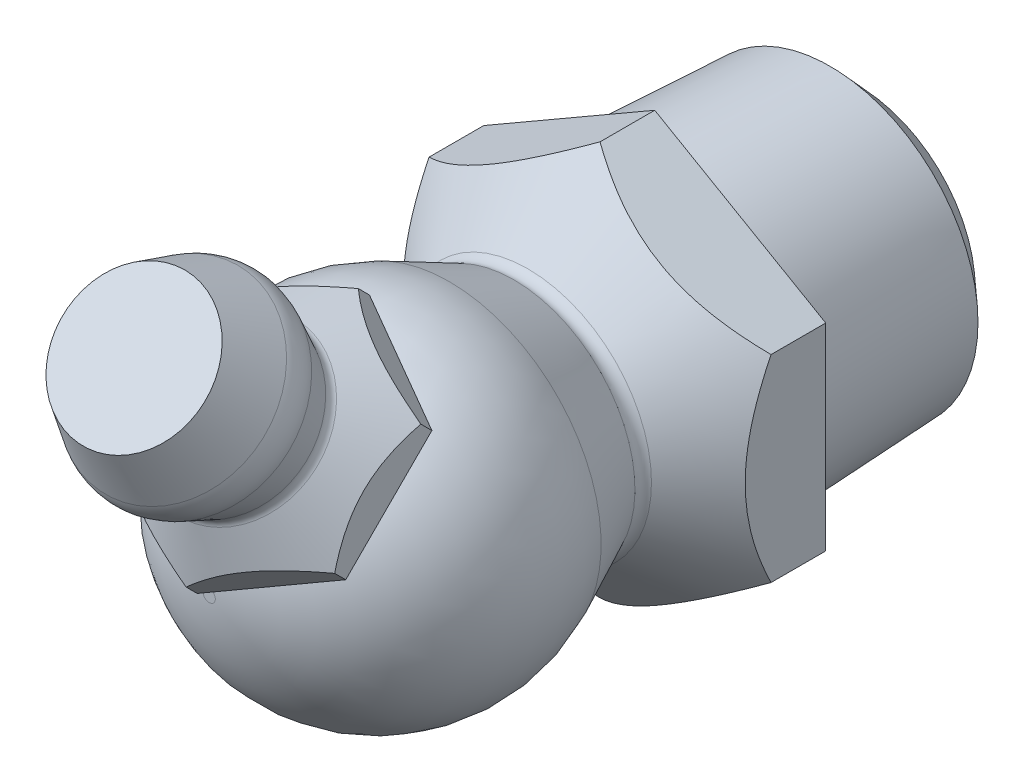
ISO-10303-21;
HEADER;
FILE_DESCRIPTION(('STEP AP214'),'2;1');
FILE_NAME('part.step','',(''),(''),'','','');
FILE_SCHEMA(('AUTOMOTIVE_DESIGN { 1 0 10303 214 1 1 1 1 }'));
ENDSEC;
DATA;
#1=APPLICATION_CONTEXT('core data for automotive mechanical design processes');
#2=APPLICATION_PROTOCOL_DEFINITION('international standard','automotive_design',2000,#1);
#3=PRODUCT_CONTEXT('',#1,'mechanical');
#4=PRODUCT('Part','Part','',(#3));
#5=PRODUCT_RELATED_PRODUCT_CATEGORY('part','',(#4));
#6=PRODUCT_DEFINITION_FORMATION('','',#4);
#7=PRODUCT_DEFINITION_CONTEXT('part definition',#1,'design');
#8=PRODUCT_DEFINITION('design','',#6,#7);
#9=PRODUCT_DEFINITION_SHAPE('','',#8);
#10=(LENGTH_UNIT() NAMED_UNIT(*) SI_UNIT(.MILLI.,.METRE.));
#11=(NAMED_UNIT(*) PLANE_ANGLE_UNIT() SI_UNIT($,.RADIAN.));
#12=(NAMED_UNIT(*) SI_UNIT($,.STERADIAN.) SOLID_ANGLE_UNIT());
#13=UNCERTAINTY_MEASURE_WITH_UNIT(LENGTH_MEASURE(1.E-05),#10,'distance_accuracy_value','');
#14=(GEOMETRIC_REPRESENTATION_CONTEXT(3) GLOBAL_UNCERTAINTY_ASSIGNED_CONTEXT((#13)) GLOBAL_UNIT_ASSIGNED_CONTEXT((#10,
#11,#12)) REPRESENTATION_CONTEXT('',''));
#15=CARTESIAN_POINT('',(0.,0.,0.));
#16=DIRECTION('',(0.,0.,1.));
#17=DIRECTION('',(1.,0.,0.));
#18=AXIS2_PLACEMENT_3D('',#15,#16,#17);
#19=CARTESIAN_POINT('',(5.55625,-3.20790243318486,21.082));
#20=DIRECTION('',(-1.,0.,0.));
#21=DIRECTION('',(0.,-1.,0.));
#22=AXIS2_PLACEMENT_3D('',#19,#20,#21);
#23=PLANE('',#22);
#24=DIRECTION('',(0.,0.,-1.));
#25=VECTOR('',#24,1.);
#26=CARTESIAN_POINT('',(5.55625,-3.20790243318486,21.082));
#27=LINE('',#26,#25);
#28=CARTESIAN_POINT('',(5.55624999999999,-3.20790243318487,8.382));
#29=VERTEX_POINT('',#28);
#30=CARTESIAN_POINT('',(5.55625,-3.20790243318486,6.604));
#31=VERTEX_POINT('',#30);
#32=EDGE_CURVE('E268',#29,#31,#27,.T.);
#33=ORIENTED_EDGE('',*,*,#32,.T.);
#34=DIRECTION('',(0.,1.,0.));
#35=VECTOR('',#34,1.);
#36=CARTESIAN_POINT('',(5.55625,-3.20790243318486,6.604));
#37=LINE('',#36,#35);
#38=CARTESIAN_POINT('',(5.55625,3.20790243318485,6.604));
#39=VERTEX_POINT('',#38);
#40=EDGE_CURVE('E60',#31,#39,#37,.T.);
#41=ORIENTED_EDGE('',*,*,#40,.T.);
#42=DIRECTION('',(0.,0.,-1.));
#43=VECTOR('',#42,1.);
#44=CARTESIAN_POINT('',(5.55625,3.20790243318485,21.082));
#45=LINE('',#44,#43);
#46=CARTESIAN_POINT('',(5.55625,3.20790243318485,8.382));
#47=VERTEX_POINT('',#46);
#48=EDGE_CURVE('E284',#47,#39,#45,.T.);
#49=ORIENTED_EDGE('',*,*,#48,.F.);
#50=CARTESIAN_POINT('',(5.55625,-6.17414003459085,6.53940433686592));
#51=CARTESIAN_POINT('',(5.55625,-6.02125618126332,6.65015094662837));
#52=CARTESIAN_POINT('',(5.55625,-5.86751171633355,6.75972958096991));
#53=CARTESIAN_POINT('',(5.55625,-5.55797230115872,6.97603597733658));
#54=CARTESIAN_POINT('',(5.55625,-5.40217682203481,7.08276298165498));
#55=CARTESIAN_POINT('',(5.55625,-5.08708816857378,7.2935940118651));
#56=CARTESIAN_POINT('',(5.55625,-4.92777737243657,7.39767179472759));
#57=CARTESIAN_POINT('',(5.55625,-4.60648237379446,7.60160275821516));
#58=CARTESIAN_POINT('',(5.55625,-4.44449836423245,7.70145624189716));
#59=CARTESIAN_POINT('',(5.55625,-4.10930234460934,7.90087178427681));
#60=CARTESIAN_POINT('',(5.55625,-3.93593320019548,8.00017107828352));
#61=CARTESIAN_POINT('',(5.55625,-3.58529889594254,8.19174329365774));
#62=CARTESIAN_POINT('',(5.55625,-3.40803317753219,8.2840151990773));
#63=CARTESIAN_POINT('',(5.55625,-3.04969380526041,8.45950310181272));
#64=CARTESIAN_POINT('',(5.55625,-2.86863303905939,8.5427452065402));
#65=CARTESIAN_POINT('',(5.55625,-2.5019092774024,8.6982864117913));
#66=CARTESIAN_POINT('',(5.55625,-2.3162482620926,8.77059012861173));
#67=CARTESIAN_POINT('',(5.55625,-1.94912062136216,8.8985878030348));
#68=CARTESIAN_POINT('',(5.55625,-1.76787503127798,8.95490858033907));
#69=CARTESIAN_POINT('',(5.55625,-1.40138617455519,9.05287862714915));
#70=CARTESIAN_POINT('',(5.55625,-1.21614265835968,9.09452697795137));
#71=CARTESIAN_POINT('',(5.55625,-0.84572233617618,9.16029443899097));
#72=CARTESIAN_POINT('',(5.55625,-0.660596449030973,9.18469564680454));
#73=CARTESIAN_POINT('',(5.55625,-0.288847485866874,9.2155373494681));
#74=CARTESIAN_POINT('',(5.55625,-0.102224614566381,9.22198025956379));
#75=CARTESIAN_POINT('',(5.55625,0.264454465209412,9.21656393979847));
#76=CARTESIAN_POINT('',(5.55625,0.444520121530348,9.20531388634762));
#77=CARTESIAN_POINT('',(5.55625,0.802849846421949,9.16635621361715));
#78=CARTESIAN_POINT('',(5.55625,0.98111372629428,9.13864688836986));
#79=CARTESIAN_POINT('',(5.55625,1.33766305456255,9.06774961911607));
#80=CARTESIAN_POINT('',(5.55625,1.51589667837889,9.02430493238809));
#81=CARTESIAN_POINT('',(5.55625,1.8685213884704,8.92416683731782));
#82=CARTESIAN_POINT('',(5.55625,2.04291294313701,8.86747505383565));
#83=CARTESIAN_POINT('',(5.55625,2.42114476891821,8.73093824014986));
#84=CARTESIAN_POINT('',(5.55625,2.62412699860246,8.64873490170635));
#85=CARTESIAN_POINT('',(5.55625,3.02462474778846,8.47184155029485));
#86=CARTESIAN_POINT('',(5.55625,3.22213729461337,8.37714490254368));
#87=CARTESIAN_POINT('',(5.55625,3.6128181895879,8.17764887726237));
#88=CARTESIAN_POINT('',(5.55625,3.8059690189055,8.07281547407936));
#89=CARTESIAN_POINT('',(5.55625,4.18781823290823,7.85546140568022));
#90=CARTESIAN_POINT('',(5.55625,4.37651742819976,7.74294215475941));
#91=CARTESIAN_POINT('',(5.55625,4.74002510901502,7.51805640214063));
#92=CARTESIAN_POINT('',(5.55625,4.91503302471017,7.40601053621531));
#93=CARTESIAN_POINT('',(5.55625,5.26214551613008,7.17749312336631));
#94=CARTESIAN_POINT('',(5.55625,5.43424986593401,7.06102123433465));
#95=CARTESIAN_POINT('',(5.55625,5.77449217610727,6.82548856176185));
#96=CARTESIAN_POINT('',(5.55625,5.94265148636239,6.70645851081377));
#97=CARTESIAN_POINT('',(5.55625,6.27679734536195,6.4654758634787));
#98=CARTESIAN_POINT('',(5.55625,6.44278445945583,6.34352405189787));
#99=CARTESIAN_POINT('',(5.55625,6.60787353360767,6.22038863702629));
#100=B_SPLINE_CURVE_WITH_KNOTS('',3,(#50,#51,#52,#53,#54,#55,#56,#57,#58,#59,#60,#61,#62,#63,
#64,#65,#66,#67,#68,#69,#70,#71,#72,#73,#74,#75,#76,#77,#78,#79,#80,#81,#82,#83,#84,#85,#86,#87,
#88,#89,#90,#91,#92,#93,#94,#95,#96,#97,#98,#99),.UNSPECIFIED.,.F.,.F.,(4,2,2,2,2,2,2,2,2,2,2,2,
2,2,2,2,2,2,2,2,2,2,2,2,4),(0.,0.566355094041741,1.13285920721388,1.70368793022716,
2.27447563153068,2.87372261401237,3.47305606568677,4.0706077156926,4.66790647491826,
5.23677270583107,5.80567454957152,6.36504137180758,6.92433296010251,7.46478545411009,
8.00529397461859,8.55505117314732,9.10474097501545,9.76118113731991,10.4179713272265,
11.0770481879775,11.736004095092,12.3593336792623,12.9827115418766,13.6007482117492,
14.2186206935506),.UNSPECIFIED.);
#101=EDGE_CURVE('E239',#47,#29,#100,.F.);
#102=ORIENTED_EDGE('',*,*,#101,.T.);
#103=EDGE_LOOP('',(#33,#41,#49,#102));
#104=FACE_BOUND('',#103,.T.);
#105=ADVANCED_FACE('F33',(#104),#23,.F.);
#106=CARTESIAN_POINT('',(5.55625,3.20790243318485,21.082));
#107=DIRECTION('',(-0.5,-0.866025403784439,0.));
#108=DIRECTION('',(0.866025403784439,-0.5,0.));
#109=AXIS2_PLACEMENT_3D('',#106,#107,#108);
#110=PLANE('',#109);
#111=ORIENTED_EDGE('',*,*,#48,.T.);
#112=DIRECTION('',(-0.866025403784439,0.5,0.));
#113=VECTOR('',#112,1.);
#114=CARTESIAN_POINT('',(5.55625,3.20790243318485,6.604));
#115=LINE('',#114,#113);
#116=CARTESIAN_POINT('',(0.,6.41580486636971,6.604));
#117=VERTEX_POINT('',#116);
#118=EDGE_CURVE('E171',#39,#117,#115,.T.);
#119=ORIENTED_EDGE('',*,*,#118,.T.);
#120=DIRECTION('',(0.,0.,-1.));
#121=VECTOR('',#120,1.);
#122=CARTESIAN_POINT('',(0.,6.41580486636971,21.082));
#123=LINE('',#122,#121);
#124=CARTESIAN_POINT('',(0.,6.41580486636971,8.382));
#125=VERTEX_POINT('',#124);
#126=EDGE_CURVE('E282',#125,#117,#123,.T.);
#127=ORIENTED_EDGE('',*,*,#126,.F.);
#128=CARTESIAN_POINT('',(-0.000200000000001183,6.41592033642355,8.381887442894));
#129=CARTESIAN_POINT('',(0.0974820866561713,6.3595235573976,8.43685456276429));
#130=CARTESIAN_POINT('',(0.195901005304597,6.30270136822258,8.49007949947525));
#131=CARTESIAN_POINT('',(0.394355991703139,6.18812332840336,8.59251303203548));
#132=CARTESIAN_POINT('',(0.494392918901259,6.13036698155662,8.64171940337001));
#133=CARTESIAN_POINT('',(0.798052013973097,5.95504932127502,8.78292023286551));
#134=CARTESIAN_POINT('',(1.00418940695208,5.83603584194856,8.86790179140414));
#135=CARTESIAN_POINT('',(1.41958295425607,5.59620826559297,9.012433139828));
#136=CARTESIAN_POINT('',(1.62873376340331,5.47545498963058,9.07237429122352));
#137=CARTESIAN_POINT('',(1.94567711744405,5.2924676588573,9.1406404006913));
#138=CARTESIAN_POINT('',(2.05175642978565,5.23122273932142,9.15978004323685));
#139=CARTESIAN_POINT('',(2.2647325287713,5.1082609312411,9.1904061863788));
#140=CARTESIAN_POINT('',(2.37162919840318,5.04654411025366,9.20189376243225));
#141=CARTESIAN_POINT('',(2.63466507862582,4.89468027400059,9.2202673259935));
#142=CARTESIAN_POINT('',(2.79105718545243,4.80438724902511,9.22267442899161));
#143=CARTESIAN_POINT('',(3.10337065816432,4.62407298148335,9.210336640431));
#144=CARTESIAN_POINT('',(3.25929181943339,4.5340518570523,9.19558513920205));
#145=CARTESIAN_POINT('',(3.56948193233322,4.35496351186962,9.14982834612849));
#146=CARTESIAN_POINT('',(3.72374884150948,4.26589747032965,9.11880489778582));
#147=CARTESIAN_POINT('',(4.02949986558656,4.08937203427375,9.04221722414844));
#148=CARTESIAN_POINT('',(4.18098423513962,4.00191249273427,8.99665433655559));
#149=CARTESIAN_POINT('',(4.43645247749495,3.85441783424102,8.90835720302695));
#150=CARTESIAN_POINT('',(4.54126548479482,3.79390401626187,8.86875395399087));
#151=CARTESIAN_POINT('',(4.74921169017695,3.67384621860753,8.78408579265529));
#152=CARTESIAN_POINT('',(4.85234502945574,3.61430215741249,8.73902134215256));
#153=CARTESIAN_POINT('',(5.05657855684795,3.49638787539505,8.64428693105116));
#154=CARTESIAN_POINT('',(5.15768463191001,3.43801425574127,8.59463377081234));
#155=CARTESIAN_POINT('',(5.35826574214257,3.32220869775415,8.49120496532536));
#156=CARTESIAN_POINT('',(5.45774130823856,3.26477645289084,8.43743069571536));
#157=CARTESIAN_POINT('',(5.55645,3.20778696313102,8.381887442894));
#158=B_SPLINE_CURVE_WITH_KNOTS('',3,(#128,#129,#130,#131,#132,#133,#134,#135,#136,#137,#138,
#139,#140,#141,#142,#143,#144,#145,#146,#147,#148,#149,#150,#151,#152,#153,#154,#155,#156,#157),
.UNSPECIFIED.,.F.,.F.,(4,2,2,2,2,2,2,2,2,2,2,2,2,2,4),(0.,0.37640019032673,0.753007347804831,
1.51021014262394,2.25509049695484,2.62680878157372,2.99847481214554,3.53942030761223,
4.0805742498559,4.62233330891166,5.16404253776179,5.54593997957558,5.92780515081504,
6.30832378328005,6.68871594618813),.UNSPECIFIED.);
#159=EDGE_CURVE('E234',#125,#47,#158,.T.);
#160=ORIENTED_EDGE('',*,*,#159,.T.);
#161=EDGE_LOOP('',(#111,#119,#127,#160));
#162=FACE_BOUND('',#161,.T.);
#163=ADVANCED_FACE('F244',(#162),#110,.F.);
#164=CARTESIAN_POINT('',(0.,6.41580486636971,21.082));
#165=DIRECTION('',(0.5,-0.866025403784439,0.));
#166=DIRECTION('',(0.866025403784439,0.5,0.));
#167=AXIS2_PLACEMENT_3D('',#164,#165,#166);
#168=PLANE('',#167);
#169=ORIENTED_EDGE('',*,*,#126,.T.);
#170=DIRECTION('',(-0.866025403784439,-0.5,0.));
#171=VECTOR('',#170,1.);
#172=CARTESIAN_POINT('',(0.,6.41580486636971,6.604));
#173=LINE('',#172,#171);
#174=CARTESIAN_POINT('',(-5.55625,3.20790243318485,6.604));
#175=VERTEX_POINT('',#174);
#176=EDGE_CURVE('E168',#117,#175,#173,.T.);
#177=ORIENTED_EDGE('',*,*,#176,.T.);
#178=DIRECTION('',(0.,0.,-1.));
#179=VECTOR('',#178,1.);
#180=CARTESIAN_POINT('',(-5.55625,3.20790243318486,21.082));
#181=LINE('',#180,#179);
#182=CARTESIAN_POINT('',(-5.55625,3.20790243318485,8.382));
#183=VERTEX_POINT('',#182);
#184=EDGE_CURVE('E280',#183,#175,#181,.T.);
#185=ORIENTED_EDGE('',*,*,#184,.F.);
#186=CARTESIAN_POINT('',(-5.55645,3.20778696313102,8.381887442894));
#187=CARTESIAN_POINT('',(-5.45876791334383,3.26418374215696,8.43685456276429));
#188=CARTESIAN_POINT('',(-5.3603489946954,3.32100593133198,8.49007949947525));
#189=CARTESIAN_POINT('',(-5.16189400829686,3.43558397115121,8.59251303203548));
#190=CARTESIAN_POINT('',(-5.06185708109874,3.49334031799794,8.64171940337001));
#191=CARTESIAN_POINT('',(-4.7581979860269,3.66865797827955,8.78292023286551));
#192=CARTESIAN_POINT('',(-4.55206059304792,3.78767145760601,8.86790179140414));
#193=CARTESIAN_POINT('',(-4.13666704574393,4.0274990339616,9.01243313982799));
#194=CARTESIAN_POINT('',(-3.92751623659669,4.14825230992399,9.07237429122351));
#195=CARTESIAN_POINT('',(-3.61057288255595,4.33123964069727,9.1406404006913));
#196=CARTESIAN_POINT('',(-3.50449357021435,4.39248456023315,9.15978004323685));
#197=CARTESIAN_POINT('',(-3.29151747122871,4.51544636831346,9.19040618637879));
#198=CARTESIAN_POINT('',(-3.18462080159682,4.57716318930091,9.20189376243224));
#199=CARTESIAN_POINT('',(-2.92158492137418,4.72902702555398,9.2202673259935));
#200=CARTESIAN_POINT('',(-2.76519281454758,4.81932005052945,9.22267442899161));
#201=CARTESIAN_POINT('',(-2.45287934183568,4.99963431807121,9.21033664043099));
#202=CARTESIAN_POINT('',(-2.29695818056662,5.08965544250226,9.19558513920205));
#203=CARTESIAN_POINT('',(-1.98676806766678,5.26874378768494,9.14982834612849));
#204=CARTESIAN_POINT('',(-1.83250115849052,5.35780982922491,9.11880489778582));
#205=CARTESIAN_POINT('',(-1.52675013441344,5.53433526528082,9.04221722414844));
#206=CARTESIAN_POINT('',(-1.37526576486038,5.62179480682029,8.99665433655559));
#207=CARTESIAN_POINT('',(-1.11979752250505,5.76928946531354,8.90835720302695));
#208=CARTESIAN_POINT('',(-1.01498451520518,5.8298032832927,8.86875395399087));
#209=CARTESIAN_POINT('',(-0.807038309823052,5.94986108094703,8.78408579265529));
#210=CARTESIAN_POINT('',(-0.703904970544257,6.00940514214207,8.73902134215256));
#211=CARTESIAN_POINT('',(-0.499671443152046,6.12731942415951,8.64428693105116));
#212=CARTESIAN_POINT('',(-0.398565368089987,6.1856930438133,8.59463377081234));
#213=CARTESIAN_POINT('',(-0.197984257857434,6.30149860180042,8.49120496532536));
#214=CARTESIAN_POINT('',(-0.0985086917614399,6.35893084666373,8.43743069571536));
#215=CARTESIAN_POINT('',(0.000199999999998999,6.41592033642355,8.381887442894));
#216=B_SPLINE_CURVE_WITH_KNOTS('',3,(#186,#187,#188,#189,#190,#191,#192,#193,#194,#195,#196,
#197,#198,#199,#200,#201,#202,#203,#204,#205,#206,#207,#208,#209,#210,#211,#212,#213,#214,#215),
.UNSPECIFIED.,.F.,.F.,(4,2,2,2,2,2,2,2,2,2,2,2,2,2,4),(0.,0.376400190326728,0.753007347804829,
1.51021014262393,2.25509049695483,2.62680878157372,2.99847481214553,3.53942030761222,
4.08057424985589,4.62233330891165,5.16404253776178,5.54593997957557,5.92780515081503,
6.30832378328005,6.68871594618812),.UNSPECIFIED.);
#217=EDGE_CURVE('E228',#183,#125,#216,.T.);
#218=ORIENTED_EDGE('',*,*,#217,.T.);
#219=EDGE_LOOP('',(#169,#177,#185,#218));
#220=FACE_BOUND('',#219,.T.);
#221=ADVANCED_FACE('F247',(#220),#168,.F.);
#222=CARTESIAN_POINT('',(-5.55625,3.20790243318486,21.082));
#223=DIRECTION('',(1.,0.,0.));
#224=DIRECTION('',(0.,0.,-1.));
#225=AXIS2_PLACEMENT_3D('',#222,#223,#224);
#226=PLANE('',#225);
#227=ORIENTED_EDGE('',*,*,#184,.T.);
#228=DIRECTION('',(0.,-1.,0.));
#229=VECTOR('',#228,1.);
#230=CARTESIAN_POINT('',(-5.55625,3.20790243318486,6.604));
#231=LINE('',#230,#229);
#232=CARTESIAN_POINT('',(-5.55624999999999,-3.20790243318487,6.604));
#233=VERTEX_POINT('',#232);
#234=EDGE_CURVE('E165',#175,#233,#231,.T.);
#235=ORIENTED_EDGE('',*,*,#234,.T.);
#236=DIRECTION('',(0.,0.,-1.));
#237=VECTOR('',#236,1.);
#238=CARTESIAN_POINT('',(-5.55625,-3.20790243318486,21.082));
#239=LINE('',#238,#237);
#240=CARTESIAN_POINT('',(-5.55625,-3.20790243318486,8.382));
#241=VERTEX_POINT('',#240);
#242=EDGE_CURVE('E275',#241,#233,#239,.T.);
#243=ORIENTED_EDGE('',*,*,#242,.F.);
#244=CARTESIAN_POINT('',(-5.55625,-6.17414002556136,6.53940434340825));
#245=CARTESIAN_POINT('',(-5.55625,-6.02125617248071,6.65015095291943));
#246=CARTESIAN_POINT('',(-5.55625,-5.86751170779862,6.75972958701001));
#247=CARTESIAN_POINT('',(-5.55625,-5.5579722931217,6.97603598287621));
#248=CARTESIAN_POINT('',(-5.55625,-5.40217681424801,7.08276298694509));
#249=CARTESIAN_POINT('',(-5.55625,-5.08708816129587,7.29359401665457));
#250=CARTESIAN_POINT('',(-5.55625,-4.92777736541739,7.39767179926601));
#251=CARTESIAN_POINT('',(-5.55625,-4.60648236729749,7.6016027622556));
#252=CARTESIAN_POINT('',(-5.55625,-4.44449835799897,7.70145624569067));
#253=CARTESIAN_POINT('',(-5.55625,-4.10930233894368,7.90087178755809));
#254=CARTESIAN_POINT('',(-5.55625,-3.93593319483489,8.00017108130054));
#255=CARTESIAN_POINT('',(-5.55625,-3.58529889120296,8.19174329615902));
#256=CARTESIAN_POINT('',(-5.55625,-3.40803317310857,8.2840152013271));
#257=CARTESIAN_POINT('',(-5.55625,-3.04969380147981,8.45950310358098));
#258=CARTESIAN_POINT('',(-5.55625,-2.86863303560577,8.54274520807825));
#259=CARTESIAN_POINT('',(-5.55625,-2.50190927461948,8.69828641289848));
#260=CARTESIAN_POINT('',(-5.55625,-2.31624825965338,8.77059012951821));
#261=CARTESIAN_POINT('',(-5.55625,-1.94912061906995,8.89858780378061));
#262=CARTESIAN_POINT('',(-5.55625,-1.76787502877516,8.95490858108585));
#263=CARTESIAN_POINT('',(-5.55625,-1.40138617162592,9.05287862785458));
#264=CARTESIAN_POINT('',(-5.55625,-1.2161426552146,9.09452697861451));
#265=CARTESIAN_POINT('',(-5.55625,-0.845722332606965,9.1602944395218));
#266=CARTESIAN_POINT('',(-5.55625,-0.660596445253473,9.18469564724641));
#267=CARTESIAN_POINT('',(-5.55625,-0.288847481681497,9.21553734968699));
#268=CARTESIAN_POINT('',(-5.55625,-0.102224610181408,9.22198025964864));
#269=CARTESIAN_POINT('',(-5.55625,0.264454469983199,9.21656393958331));
#270=CARTESIAN_POINT('',(-5.55625,0.444520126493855,9.20531388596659));
#271=CARTESIAN_POINT('',(-5.55625,0.802849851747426,9.16635621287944));
#272=CARTESIAN_POINT('',(-5.55625,0.981113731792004,9.13864688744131));
#273=CARTESIAN_POINT('',(-5.55625,1.33766306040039,9.06774961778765));
#274=CARTESIAN_POINT('',(-5.55625,1.51589668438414,9.02430493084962));
#275=CARTESIAN_POINT('',(-5.55625,1.86852139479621,8.9241668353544));
#276=CARTESIAN_POINT('',(-5.55625,2.04291294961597,8.86747505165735));
#277=CARTESIAN_POINT('',(-5.55625,2.42114477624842,8.73093823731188));
#278=CARTESIAN_POINT('',(-5.55625,2.62412700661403,8.64873489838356));
#279=CARTESIAN_POINT('',(-5.55625,3.02462475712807,8.47184154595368));
#280=CARTESIAN_POINT('',(-5.55625,3.22213730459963,8.37714489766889));
#281=CARTESIAN_POINT('',(-5.55625,3.61281820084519,8.17764887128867));
#282=CARTESIAN_POINT('',(-5.55625,3.80596903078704,8.07281546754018));
#283=CARTESIAN_POINT('',(-5.55625,4.18781824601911,7.85546139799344));
#284=CARTESIAN_POINT('',(-5.55625,4.37651744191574,7.74294214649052));
#285=CARTESIAN_POINT('',(-5.55625,4.74002512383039,7.51805639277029));
#286=CARTESIAN_POINT('',(-5.55625,4.91503304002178,7.40601052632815));
#287=CARTESIAN_POINT('',(-5.55625,5.26214553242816,7.17749311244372));
#288=CARTESIAN_POINT('',(-5.55625,5.43424988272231,7.06102122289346));
#289=CARTESIAN_POINT('',(-5.55625,5.774492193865,6.82548854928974));
#290=CARTESIAN_POINT('',(-5.55625,5.94265150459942,6.70645849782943));
#291=CARTESIAN_POINT('',(-5.55625,6.2767973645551,6.46547584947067));
#292=CARTESIAN_POINT('',(-5.55625,6.44278447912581,6.34352403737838));
#293=CARTESIAN_POINT('',(-5.55625,6.60787355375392,6.22038862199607));
#294=B_SPLINE_CURVE_WITH_KNOTS('',3,(#244,#245,#246,#247,#248,#249,#250,#251,#252,#253,#254,
#255,#256,#257,#258,#259,#260,#261,#262,#263,#264,#265,#266,#267,#268,#269,#270,#271,#272,#273,
#274,#275,#276,#277,#278,#279,#280,#281,#282,#283,#284,#285,#286,#287,#288,#289,#290,#291,#292,
#293),.UNSPECIFIED.,.F.,.F.,(4,2,2,2,2,2,2,2,2,2,2,2,2,2,2,2,2,2,2,2,2,2,2,2,4),(0.,
0.566355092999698,1.13285920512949,1.70368792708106,2.274475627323,2.87372260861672,
3.47305605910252,4.07060770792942,4.66790646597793,5.23677269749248,5.8056745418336,
6.36504136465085,6.92433295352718,7.46478544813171,8.00529396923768,8.55505116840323,
9.10474097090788,9.76118113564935,10.4179713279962,11.0770481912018,11.7360041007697,
12.3593336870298,12.9827115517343,13.6007482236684,14.2186207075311),.UNSPECIFIED.);
#295=EDGE_CURVE('E195',#241,#183,#294,.T.);
#296=ORIENTED_EDGE('',*,*,#295,.T.);
#297=EDGE_LOOP('',(#227,#235,#243,#296));
#298=FACE_BOUND('',#297,.T.);
#299=ADVANCED_FACE('F251',(#298),#226,.F.);
#300=CARTESIAN_POINT('',(-5.55625,-3.20790243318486,21.082));
#301=DIRECTION('',(0.5,0.866025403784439,0.));
#302=DIRECTION('',(-0.866025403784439,0.5,0.));
#303=AXIS2_PLACEMENT_3D('',#300,#301,#302);
#304=PLANE('',#303);
#305=ORIENTED_EDGE('',*,*,#242,.T.);
#306=DIRECTION('',(0.866025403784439,-0.5,0.));
#307=VECTOR('',#306,1.);
#308=CARTESIAN_POINT('',(-5.55625,-3.20790243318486,6.604));
#309=LINE('',#308,#307);
#310=CARTESIAN_POINT('',(0.,-6.41580486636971,6.604));
#311=VERTEX_POINT('',#310);
#312=EDGE_CURVE('E162',#233,#311,#309,.T.);
#313=ORIENTED_EDGE('',*,*,#312,.T.);
#314=DIRECTION('',(0.,0.,-1.));
#315=VECTOR('',#314,1.);
#316=CARTESIAN_POINT('',(0.,-6.41580486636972,21.082));
#317=LINE('',#316,#315);
#318=CARTESIAN_POINT('',(0.,-6.41580486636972,8.382));
#319=VERTEX_POINT('',#318);
#320=EDGE_CURVE('E273',#319,#311,#317,.T.);
#321=ORIENTED_EDGE('',*,*,#320,.F.);
#322=CARTESIAN_POINT('',(0.000199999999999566,-6.41592033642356,8.381887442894));
#323=CARTESIAN_POINT('',(-0.0974820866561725,-6.35952355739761,8.43685456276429));
#324=CARTESIAN_POINT('',(-0.195901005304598,-6.30270136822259,8.49007949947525));
#325=CARTESIAN_POINT('',(-0.394355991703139,-6.18812332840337,8.59251303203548));
#326=CARTESIAN_POINT('',(-0.49439291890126,-6.13036698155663,8.64171940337));
#327=CARTESIAN_POINT('',(-0.798052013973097,-5.95504932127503,8.7829202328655));
#328=CARTESIAN_POINT('',(-1.00418940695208,-5.83603584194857,8.86790179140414));
#329=CARTESIAN_POINT('',(-1.41958295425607,-5.59620826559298,9.01243313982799));
#330=CARTESIAN_POINT('',(-1.62873376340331,-5.47545498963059,9.07237429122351));
#331=CARTESIAN_POINT('',(-1.94567711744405,-5.2924676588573,9.1406404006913));
#332=CARTESIAN_POINT('',(-2.05175642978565,-5.23122273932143,9.15978004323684));
#333=CARTESIAN_POINT('',(-2.26473252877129,-5.10826093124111,9.19040618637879));
#334=CARTESIAN_POINT('',(-2.37162919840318,-5.04654411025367,9.20189376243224));
#335=CARTESIAN_POINT('',(-2.63466507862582,-4.8946802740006,9.22026732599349));
#336=CARTESIAN_POINT('',(-2.79105718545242,-4.80438724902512,9.22267442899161));
#337=CARTESIAN_POINT('',(-3.10337065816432,-4.62407298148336,9.21033664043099));
#338=CARTESIAN_POINT('',(-3.25929181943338,-4.53405185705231,9.19558513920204));
#339=CARTESIAN_POINT('',(-3.56948193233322,-4.35496351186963,9.14982834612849));
#340=CARTESIAN_POINT('',(-3.72374884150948,-4.26589747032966,9.11880489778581));
#341=CARTESIAN_POINT('',(-4.02949986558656,-4.08937203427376,9.04221722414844));
#342=CARTESIAN_POINT('',(-4.18098423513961,-4.00191249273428,8.99665433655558));
#343=CARTESIAN_POINT('',(-4.43645247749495,-3.85441783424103,8.90835720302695));
#344=CARTESIAN_POINT('',(-4.54126548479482,-3.79390401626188,8.86875395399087));
#345=CARTESIAN_POINT('',(-4.74921169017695,-3.67384621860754,8.78408579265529));
#346=CARTESIAN_POINT('',(-4.85234502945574,-3.6143021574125,8.73902134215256));
#347=CARTESIAN_POINT('',(-5.05657855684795,-3.49638787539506,8.64428693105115));
#348=CARTESIAN_POINT('',(-5.15768463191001,-3.43801425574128,8.59463377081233));
#349=CARTESIAN_POINT('',(-5.35826574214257,-3.32220869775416,8.49120496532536));
#350=CARTESIAN_POINT('',(-5.45774130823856,-3.26477645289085,8.43743069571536));
#351=CARTESIAN_POINT('',(-5.55645,-3.20778696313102,8.381887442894));
#352=B_SPLINE_CURVE_WITH_KNOTS('',3,(#322,#323,#324,#325,#326,#327,#328,#329,#330,#331,#332,
#333,#334,#335,#336,#337,#338,#339,#340,#341,#342,#343,#344,#345,#346,#347,#348,#349,#350,#351),
.UNSPECIFIED.,.F.,.F.,(4,2,2,2,2,2,2,2,2,2,2,2,2,2,4),(0.,0.376400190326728,0.753007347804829,
1.51021014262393,2.25509049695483,2.62680878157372,2.99847481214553,3.53942030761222,
4.08057424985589,4.62233330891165,5.16404253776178,5.54593997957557,5.92780515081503,
6.30832378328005,6.68871594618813),.UNSPECIFIED.);
#353=EDGE_CURVE('E187',#319,#241,#352,.T.);
#354=ORIENTED_EDGE('',*,*,#353,.T.);
#355=EDGE_LOOP('',(#305,#313,#321,#354));
#356=FACE_BOUND('',#355,.T.);
#357=ADVANCED_FACE('F201',(#356),#304,.F.);
#358=CARTESIAN_POINT('',(0.,-6.41580486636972,21.082));
#359=DIRECTION('',(-0.5,0.866025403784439,0.));
#360=DIRECTION('',(-0.866025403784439,-0.5,0.));
#361=AXIS2_PLACEMENT_3D('',#358,#359,#360);
#362=PLANE('',#361);
#363=ORIENTED_EDGE('',*,*,#320,.T.);
#364=DIRECTION('',(0.866025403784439,0.5,0.));
#365=VECTOR('',#364,1.);
#366=CARTESIAN_POINT('',(0.,-6.41580486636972,6.604));
#367=LINE('',#366,#365);
#368=EDGE_CURVE('E285',#311,#31,#367,.T.);
#369=ORIENTED_EDGE('',*,*,#368,.T.);
#370=ORIENTED_EDGE('',*,*,#32,.F.);
#371=CARTESIAN_POINT('',(5.55645,-3.20778696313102,8.381887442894));
#372=CARTESIAN_POINT('',(5.45876791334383,-3.26418374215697,8.43685456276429));
#373=CARTESIAN_POINT('',(5.3603489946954,-3.32100593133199,8.49007949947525));
#374=CARTESIAN_POINT('',(5.16189400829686,-3.43558397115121,8.59251303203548));
#375=CARTESIAN_POINT('',(5.06185708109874,-3.49334031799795,8.64171940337));
#376=CARTESIAN_POINT('',(4.7581979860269,-3.66865797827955,8.7829202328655));
#377=CARTESIAN_POINT('',(4.55206059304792,-3.78767145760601,8.86790179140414));
#378=CARTESIAN_POINT('',(4.13666704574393,-4.0274990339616,9.01243313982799));
#379=CARTESIAN_POINT('',(3.92751623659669,-4.14825230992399,9.07237429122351));
#380=CARTESIAN_POINT('',(3.61057288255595,-4.33123964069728,9.1406404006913));
#381=CARTESIAN_POINT('',(3.50449357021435,-4.39248456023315,9.15978004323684));
#382=CARTESIAN_POINT('',(3.29151747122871,-4.51544636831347,9.19040618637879));
#383=CARTESIAN_POINT('',(3.18462080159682,-4.57716318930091,9.20189376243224));
#384=CARTESIAN_POINT('',(2.92158492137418,-4.72902702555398,9.22026732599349));
#385=CARTESIAN_POINT('',(2.76519281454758,-4.81932005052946,9.22267442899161));
#386=CARTESIAN_POINT('',(2.45287934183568,-4.99963431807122,9.21033664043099));
#387=CARTESIAN_POINT('',(2.29695818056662,-5.08965544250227,9.19558513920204));
#388=CARTESIAN_POINT('',(1.98676806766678,-5.26874378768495,9.14982834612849));
#389=CARTESIAN_POINT('',(1.83250115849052,-5.35780982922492,9.11880489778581));
#390=CARTESIAN_POINT('',(1.52675013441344,-5.53433526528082,9.04221722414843));
#391=CARTESIAN_POINT('',(1.37526576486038,-5.6217948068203,8.99665433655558));
#392=CARTESIAN_POINT('',(1.11979752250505,-5.76928946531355,8.90835720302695));
#393=CARTESIAN_POINT('',(1.01498451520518,-5.8298032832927,8.86875395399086));
#394=CARTESIAN_POINT('',(0.807038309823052,-5.94986108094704,8.78408579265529));
#395=CARTESIAN_POINT('',(0.703904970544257,-6.00940514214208,8.73902134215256));
#396=CARTESIAN_POINT('',(0.499671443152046,-6.12731942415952,8.64428693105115));
#397=CARTESIAN_POINT('',(0.398565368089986,-6.1856930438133,8.59463377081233));
#398=CARTESIAN_POINT('',(0.197984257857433,-6.30149860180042,8.49120496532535));
#399=CARTESIAN_POINT('',(0.0985086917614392,-6.35893084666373,8.43743069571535));
#400=CARTESIAN_POINT('',(-0.000200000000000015,-6.41592033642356,8.381887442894));
#401=B_SPLINE_CURVE_WITH_KNOTS('',3,(#371,#372,#373,#374,#375,#376,#377,#378,#379,#380,#381,
#382,#383,#384,#385,#386,#387,#388,#389,#390,#391,#392,#393,#394,#395,#396,#397,#398,#399,#400),
.UNSPECIFIED.,.F.,.F.,(4,2,2,2,2,2,2,2,2,2,2,2,2,2,4),(0.,0.376400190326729,0.753007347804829,
1.51021014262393,2.25509049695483,2.62680878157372,2.99847481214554,3.53942030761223,
4.0805742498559,4.62233330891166,5.16404253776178,5.54593997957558,5.92780515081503,
6.30832378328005,6.68871594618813),.UNSPECIFIED.);
#402=EDGE_CURVE('E218',#29,#319,#401,.T.);
#403=ORIENTED_EDGE('',*,*,#402,.T.);
#404=EDGE_LOOP('',(#363,#369,#370,#403));
#405=FACE_BOUND('',#404,.T.);
#406=ADVANCED_FACE('F210',(#405),#362,.F.);
#407=CARTESIAN_POINT('',(0.,0.,10.7237433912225));
#408=DIRECTION('',(0.,0.,-1.));
#409=DIRECTION('',(0.,1.,0.));
#410=AXIS2_PLACEMENT_3D('',#407,#408,#409);
#411=CONICAL_SURFACE('',#410,4.0133929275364,0.798185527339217);
#412=CARTESIAN_POINT('',(0.,0.,10.7237433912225));
#413=DIRECTION('',(0.,0.,-1.));
#414=DIRECTION('',(0.,1.,0.));
#415=AXIS2_PLACEMENT_3D('',#412,#413,#414);
#416=CIRCLE('',#415,4.0133929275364);
#417=CARTESIAN_POINT('',(0.,4.0133929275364,10.7237433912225));
#418=VERTEX_POINT('',#417);
#419=EDGE_CURVE('E181',#418,#418,#416,.T.);
#420=ORIENTED_EDGE('',*,*,#419,.T.);
#421=EDGE_LOOP('',(#420));
#422=FACE_BOUND('',#421,.T.);
#423=ORIENTED_EDGE('',*,*,#159,.F.);
#424=ORIENTED_EDGE('',*,*,#217,.F.);
#425=ORIENTED_EDGE('',*,*,#295,.F.);
#426=ORIENTED_EDGE('',*,*,#353,.F.);
#427=ORIENTED_EDGE('',*,*,#402,.F.);
#428=ORIENTED_EDGE('',*,*,#101,.F.);
#429=EDGE_LOOP('',(#423,#424,#425,#426,#427,#428));
#430=FACE_BOUND('',#429,.T.);
#431=ADVANCED_FACE('F204',(#422,#430),#411,.T.);
#432=CARTESIAN_POINT('',(0.,0.,15.6246065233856));
#433=DIRECTION('',(0.,0.,-1.));
#434=DIRECTION('',(0.,1.,0.));
#435=AXIS2_PLACEMENT_3D('',#432,#433,#434);
#436=SPHERICAL_SURFACE('',#435,5.461);
#437=CARTESIAN_POINT('',(0.,3.05148381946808,18.6760903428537));
#438=DIRECTION('',(0.,0.707106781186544,0.707106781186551));
#439=DIRECTION('',(0.,-0.707106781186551,0.707106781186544));
#440=AXIS2_PLACEMENT_3D('',#437,#438,#439);
#441=CIRCLE('',#440,3.34655255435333);
#442=CARTESIAN_POINT('',(0.,0.685113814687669,21.0424603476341));
#443=VERTEX_POINT('',#442);
#444=EDGE_CURVE('E156',#443,#443,#441,.T.);
#445=ORIENTED_EDGE('',*,*,#444,.F.);
#446=EDGE_LOOP('',(#445));
#447=FACE_BOUND('',#446,.T.);
#448=CARTESIAN_POINT('',(0.,0.,13.2780757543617));
#449=DIRECTION('',(0.,0.,-1.));
#450=DIRECTION('',(0.,1.,0.));
#451=AXIS2_PLACEMENT_3D('',#448,#449,#450);
#452=CIRCLE('',#451,4.93115750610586);
#453=CARTESIAN_POINT('',(0.,4.93115750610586,13.2780757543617));
#454=VERTEX_POINT('',#453);
#455=EDGE_CURVE('E175',#454,#454,#452,.T.);
#456=ORIENTED_EDGE('',*,*,#455,.F.);
#457=EDGE_LOOP('',(#456));
#458=FACE_BOUND('',#457,.T.);
#459=CARTESIAN_POINT('',(0.,0.,21.082));
#460=DIRECTION('',(0.,0.,-1.));
#461=DIRECTION('',(0.,1.,0.));
#462=AXIS2_PLACEMENT_3D('',#459,#460,#461);
#463=CIRCLE('',#462,0.1984375);
#464=CARTESIAN_POINT('',(0.,0.198437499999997,21.082));
#465=VERTEX_POINT('',#464);
#466=EDGE_CURVE('E184',#465,#465,#463,.T.);
#467=ORIENTED_EDGE('',*,*,#466,.T.);
#468=EDGE_LOOP('',(#467));
#469=FACE_BOUND('',#468,.T.);
#470=ADVANCED_FACE('F209',(#447,#458,#469),#436,.T.);
#471=CARTESIAN_POINT('',(0.,0.,11.0079419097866));
#472=DIRECTION('',(0.,0.,-1.));
#473=DIRECTION('',(0.,1.,0.));
#474=AXIS2_PLACEMENT_3D('',#471,#472,#473);
#475=TOROIDAL_SURFACE('',#474,4.29041452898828,0.396875);
#476=ORIENTED_EDGE('',*,*,#419,.F.);
#477=EDGE_LOOP('',(#476));
#478=FACE_BOUND('',#477,.T.);
#479=CARTESIAN_POINT('',(0.,0.,11.1784746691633));
#480=DIRECTION('',(0.,0.,-1.));
#481=DIRECTION('',(0.,1.,0.));
#482=AXIS2_PLACEMENT_3D('',#479,#480,#481);
#483=CIRCLE('',#482,3.93204552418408);
#484=CARTESIAN_POINT('',(0.,3.93204552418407,11.1784746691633));
#485=VERTEX_POINT('',#484);
#486=EDGE_CURVE('E178',#485,#485,#483,.T.);
#487=ORIENTED_EDGE('',*,*,#486,.T.);
#488=EDGE_LOOP('',(#487));
#489=FACE_BOUND('',#488,.T.);
#490=ADVANCED_FACE('F212',(#478,#489),#475,.F.);
#491=CARTESIAN_POINT('',(0.,0.,13.2780757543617));
#492=DIRECTION('',(0.,0.,1.));
#493=DIRECTION('',(0.,-1.,0.));
#494=AXIS2_PLACEMENT_3D('',#491,#492,#493);
#495=CONICAL_SURFACE('',#494,4.93115750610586,0.444148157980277);
#496=ORIENTED_EDGE('',*,*,#486,.F.);
#497=EDGE_LOOP('',(#496));
#498=FACE_BOUND('',#497,.T.);
#499=ORIENTED_EDGE('',*,*,#455,.T.);
#500=EDGE_LOOP('',(#499));
#501=FACE_BOUND('',#500,.T.);
#502=ADVANCED_FACE('F313',(#498,#501),#495,.T.);
#503=CARTESIAN_POINT('',(5.55625,9.62370729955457,21.082));
#504=DIRECTION('',(0.,0.,1.));
#505=DIRECTION('',(1.,0.,0.));
#506=AXIS2_PLACEMENT_3D('',#503,#504,#505);
#507=PLANE('',#506);
#508=ORIENTED_EDGE('',*,*,#466,.F.);
#509=EDGE_LOOP('',(#508));
#510=FACE_BOUND('',#509,.T.);
#511=ADVANCED_FACE('F311',(#510),#507,.T.);
#512=CARTESIAN_POINT('',(0.,6.41580486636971,6.604));
#513=DIRECTION('',(0.,0.,1.));
#514=DIRECTION('',(0.,-1.,0.));
#515=AXIS2_PLACEMENT_3D('',#512,#513,#514);
#516=PLANE('',#515);
#517=CARTESIAN_POINT('',(0.,0.,6.604));
#518=DIRECTION('',(0.,0.,-1.));
#519=DIRECTION('',(0.,1.,0.));
#520=AXIS2_PLACEMENT_3D('',#517,#518,#519);
#521=CIRCLE('',#520,5.08);
#522=CARTESIAN_POINT('',(0.,5.08,6.604));
#523=VERTEX_POINT('',#522);
#524=EDGE_CURVE('E159',#523,#523,#521,.T.);
#525=ORIENTED_EDGE('',*,*,#524,.F.);
#526=EDGE_LOOP('',(#525));
#527=FACE_BOUND('',#526,.T.);
#528=ORIENTED_EDGE('',*,*,#368,.F.);
#529=ORIENTED_EDGE('',*,*,#312,.F.);
#530=ORIENTED_EDGE('',*,*,#234,.F.);
#531=ORIENTED_EDGE('',*,*,#176,.F.);
#532=ORIENTED_EDGE('',*,*,#118,.F.);
#533=ORIENTED_EDGE('',*,*,#40,.F.);
#534=EDGE_LOOP('',(#528,#529,#530,#531,#532,#533));
#535=FACE_BOUND('',#534,.T.);
#536=ADVANCED_FACE('F308',(#527,#535),#516,.F.);
#537=CARTESIAN_POINT('',(0.,0.,6.604));
#538=DIRECTION('',(0.,0.,1.));
#539=DIRECTION('',(0.,-1.,0.));
#540=AXIS2_PLACEMENT_3D('',#537,#538,#539);
#541=CONICAL_SURFACE('',#540,5.08,0.0480399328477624);
#542=CARTESIAN_POINT('',(0.,0.,0.906096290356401));
#543=DIRECTION('',(0.,0.,-1.));
#544=DIRECTION('',(-1.,0.,0.));
#545=AXIS2_PLACEMENT_3D('',#542,#543,#544);
#546=CIRCLE('',#545,4.80606232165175);
#547=CARTESIAN_POINT('',(-4.80606232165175,0.,0.906096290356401));
#548=VERTEX_POINT('',#547);
#549=EDGE_CURVE('E46',#548,#548,#546,.F.);
#550=ORIENTED_EDGE('',*,*,#549,.T.);
#551=EDGE_LOOP('',(#550));
#552=FACE_BOUND('',#551,.T.);
#553=ORIENTED_EDGE('',*,*,#524,.T.);
#554=EDGE_LOOP('',(#553));
#555=FACE_BOUND('',#554,.T.);
#556=ADVANCED_FACE('F293',(#552,#555),#541,.T.);
#557=CARTESIAN_POINT('',(5.55625,9.62370729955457,0.));
#558=DIRECTION('',(0.,0.,1.));
#559=DIRECTION('',(1.,0.,0.));
#560=AXIS2_PLACEMENT_3D('',#557,#558,#559);
#561=PLANE('',#560);
#562=CARTESIAN_POINT('',(0.,0.,0.));
#563=DIRECTION('',(0.,0.,1.));
#564=DIRECTION('',(1.,0.,0.));
#565=AXIS2_PLACEMENT_3D('',#562,#563,#564);
#566=CIRCLE('',#565,3.80844115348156);
#567=CARTESIAN_POINT('',(3.80844115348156,0.,0.));
#568=VERTEX_POINT('',#567);
#569=EDGE_CURVE('E287',#568,#568,#566,.F.);
#570=ORIENTED_EDGE('',*,*,#569,.T.);
#571=EDGE_LOOP('',(#570));
#572=FACE_BOUND('',#571,.T.);
#573=ADVANCED_FACE('F300',(#572),#561,.F.);
#574=CARTESIAN_POINT('',(0.,0.,0.));
#575=DIRECTION('',(0.,0.,1.));
#576=DIRECTION('',(1.,0.,0.));
#577=AXIS2_PLACEMENT_3D('',#574,#575,#576);
#578=CONICAL_SURFACE('',#577,3.80844115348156,0.833438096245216);
#579=ORIENTED_EDGE('',*,*,#549,.F.);
#580=EDGE_LOOP('',(#579));
#581=FACE_BOUND('',#580,.T.);
#582=ORIENTED_EDGE('',*,*,#569,.F.);
#583=EDGE_LOOP('',(#582));
#584=FACE_BOUND('',#583,.T.);
#585=ADVANCED_FACE('F296',(#581,#584),#578,.T.);
#586=CARTESIAN_POINT('',(-3.429,1.65340369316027,20.0741704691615));
#587=DIRECTION('',(0.,0.707106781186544,0.707106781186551));
#588=DIRECTION('',(0.,-0.707106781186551,0.707106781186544));
#589=AXIS2_PLACEMENT_3D('',#586,#587,#588);
#590=PLANE('',#589);
#591=DIRECTION('',(0.,-0.707106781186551,0.707106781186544));
#592=VECTOR('',#591,1.);
#593=CARTESIAN_POINT('',(-3.429,4.45317046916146,17.2744036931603));
#594=LINE('',#593,#592);
#595=CARTESIAN_POINT('',(-3.429,4.45317046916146,17.2744036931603));
#596=VERTEX_POINT('',#595);
#597=CARTESIAN_POINT('',(-3.429,1.65340369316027,20.0741704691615));
#598=VERTEX_POINT('',#597);
#599=EDGE_CURVE('E410',#596,#598,#594,.T.);
#600=ORIENTED_EDGE('',*,*,#599,.F.);
#601=DIRECTION('',(-0.866025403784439,-0.353553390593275,0.353553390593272));
#602=VECTOR('',#601,1.);
#603=CARTESIAN_POINT('',(0.,5.85305385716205,15.8745203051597));
#604=LINE('',#603,#602);
#605=CARTESIAN_POINT('',(0.,5.85305385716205,15.8745203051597));
#606=VERTEX_POINT('',#605);
#607=EDGE_CURVE('E422',#606,#596,#604,.T.);
#608=ORIENTED_EDGE('',*,*,#607,.F.);
#609=DIRECTION('',(-0.866025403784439,0.353553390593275,-0.353553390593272));
#610=VECTOR('',#609,1.);
#611=CARTESIAN_POINT('',(3.429,4.45317046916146,17.2744036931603));
#612=LINE('',#611,#610);
#613=CARTESIAN_POINT('',(3.429,4.45317046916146,17.2744036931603));
#614=VERTEX_POINT('',#613);
#615=EDGE_CURVE('E420',#614,#606,#612,.T.);
#616=ORIENTED_EDGE('',*,*,#615,.F.);
#617=DIRECTION('',(0.,0.707106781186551,-0.707106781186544));
#618=VECTOR('',#617,1.);
#619=CARTESIAN_POINT('',(3.429,1.65340369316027,20.0741704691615));
#620=LINE('',#619,#618);
#621=CARTESIAN_POINT('',(3.429,1.65340369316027,20.0741704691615));
#622=VERTEX_POINT('',#621);
#623=EDGE_CURVE('E143',#622,#614,#620,.T.);
#624=ORIENTED_EDGE('',*,*,#623,.F.);
#625=DIRECTION('',(0.866025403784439,0.353553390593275,-0.353553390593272));
#626=VECTOR('',#625,1.);
#627=CARTESIAN_POINT('',(0.,0.25352030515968,21.4740538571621));
#628=LINE('',#627,#626);
#629=CARTESIAN_POINT('',(0.,0.25352030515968,21.4740538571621));
#630=VERTEX_POINT('',#629);
#631=EDGE_CURVE('E416',#630,#622,#628,.T.);
#632=ORIENTED_EDGE('',*,*,#631,.F.);
#633=DIRECTION('',(0.866025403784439,-0.353553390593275,0.353553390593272));
#634=VECTOR('',#633,1.);
#635=CARTESIAN_POINT('',(-3.429,1.65340369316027,20.0741704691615));
#636=LINE('',#635,#634);
#637=EDGE_CURVE('E413',#598,#630,#636,.T.);
#638=ORIENTED_EDGE('',*,*,#637,.F.);
#639=EDGE_LOOP('',(#600,#608,#616,#624,#632,#638));
#640=FACE_BOUND('',#639,.T.);
#641=ORIENTED_EDGE('',*,*,#444,.T.);
#642=EDGE_LOOP('',(#641));
#643=FACE_BOUND('',#642,.T.);
#644=ADVANCED_FACE('F299',(#640,#643),#590,.F.);
#645=CARTESIAN_POINT('',(-3.429,9.30250877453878,22.1237419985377));
#646=DIRECTION('',(1.,0.,0.));
#647=DIRECTION('',(0.,1.,0.));
#648=AXIS2_PLACEMENT_3D('',#645,#646,#647);
#649=PLANE('',#648);
#650=DIRECTION('',(0.,-0.707106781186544,-0.707106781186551));
#651=VECTOR('',#650,1.);
#652=CARTESIAN_POINT('',(-3.429,6.50274199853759,24.9235087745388));
#653=LINE('',#652,#651);
#654=CARTESIAN_POINT('',(-3.42899999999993,2.01261393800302,20.4333807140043));
#655=VERTEX_POINT('',#654);
#656=EDGE_CURVE('E154',#655,#598,#653,.T.);
#657=ORIENTED_EDGE('',*,*,#656,.F.);
#658=CARTESIAN_POINT('',(-3.429,-6.28975838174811,20.6161580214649));
#659=CARTESIAN_POINT('',(-3.429,-6.1073364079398,20.6261753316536));
#660=CARTESIAN_POINT('',(-3.429,-5.92489697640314,20.6358729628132));
#661=CARTESIAN_POINT('',(-3.429,-5.55997868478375,20.6545284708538));
#662=CARTESIAN_POINT('',(-3.429,-5.37749982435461,20.6634863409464));
#663=CARTESIAN_POINT('',(-3.429,-4.82962098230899,20.6891172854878));
#664=CARTESIAN_POINT('',(-3.429,-4.46415993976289,20.7045263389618));
#665=CARTESIAN_POINT('',(-3.429,-3.71732227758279,20.7313983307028));
#666=CARTESIAN_POINT('',(-3.429,-3.33593835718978,20.7426626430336));
#667=CARTESIAN_POINT('',(-3.429,-2.57335865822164,20.7583102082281));
#668=CARTESIAN_POINT('',(-3.429,-2.19216303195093,20.7626998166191));
#669=CARTESIAN_POINT('',(-3.429,-1.62050797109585,20.7616686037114));
#670=CARTESIAN_POINT('',(-3.429,-1.43004308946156,20.7600574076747));
#671=CARTESIAN_POINT('',(-3.429,-1.04915387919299,20.7536686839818));
#672=CARTESIAN_POINT('',(-3.429,-0.858729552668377,20.7488910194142));
#673=CARTESIAN_POINT('',(-3.429,-0.477438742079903,20.7353428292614));
#674=CARTESIAN_POINT('',(-3.429,-0.286572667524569,20.7265602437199));
#675=CARTESIAN_POINT('',(-3.429,0.0948446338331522,20.7038780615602));
#676=CARTESIAN_POINT('',(-3.429,0.2853958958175,20.6899790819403));
#677=CARTESIAN_POINT('',(-3.429,0.662239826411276,20.6558336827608));
#678=CARTESIAN_POINT('',(-3.429,0.84854370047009,20.6357149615));
#679=CARTESIAN_POINT('',(-3.429,1.22018779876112,20.586947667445));
#680=CARTESIAN_POINT('',(-3.429,1.4055273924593,20.5582940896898));
#681=CARTESIAN_POINT('',(-3.429,1.773132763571,20.4896723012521));
#682=CARTESIAN_POINT('',(-3.429,1.95540966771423,20.449765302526));
#683=CARTESIAN_POINT('',(-3.429,2.31580510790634,20.3544852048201));
#684=CARTESIAN_POINT('',(-3.429,2.49392971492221,20.299136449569));
#685=CARTESIAN_POINT('',(-3.429,2.75645485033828,20.2000719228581));
#686=CARTESIAN_POINT('',(-3.429,2.84376662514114,20.164074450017));
#687=CARTESIAN_POINT('',(-3.429,3.01568799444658,20.085955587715));
#688=CARTESIAN_POINT('',(-3.429,3.10029632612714,20.0438313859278));
#689=CARTESIAN_POINT('',(-3.429,3.26544124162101,19.9530400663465));
#690=CARTESIAN_POINT('',(-3.429,3.34599483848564,19.9044040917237));
#691=CARTESIAN_POINT('',(-3.429,3.5023549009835,19.800036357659));
#692=CARTESIAN_POINT('',(-3.429,3.57816387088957,19.7443083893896));
#693=CARTESIAN_POINT('',(-3.429,3.68888693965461,19.6542863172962));
#694=CARTESIAN_POINT('',(-3.429,3.72592730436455,19.6225807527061));
#695=CARTESIAN_POINT('',(-3.429,3.7983476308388,19.557289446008));
#696=CARTESIAN_POINT('',(-3.429,3.83372671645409,19.5237027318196));
#697=CARTESIAN_POINT('',(-3.429,3.93119079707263,19.4262323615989));
#698=CARTESIAN_POINT('',(-3.429,3.99119278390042,19.3602418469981));
#699=CARTESIAN_POINT('',(-3.429,4.10483285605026,19.2229542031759));
#700=CARTESIAN_POINT('',(-3.429,4.15846702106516,19.151653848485));
#701=CARTESIAN_POINT('',(-3.429,4.259449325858,19.0044899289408));
#702=CARTESIAN_POINT('',(-3.429,4.30678160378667,18.9286155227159));
#703=CARTESIAN_POINT('',(-3.429,4.39530623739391,18.7733950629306));
#704=CARTESIAN_POINT('',(-3.429,4.43649848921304,18.6940489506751));
#705=CARTESIAN_POINT('',(-3.429,4.53574728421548,18.4854612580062));
#706=CARTESIAN_POINT('',(-3.429,4.58956082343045,18.354200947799));
#707=CARTESIAN_POINT('',(-3.429,4.68556661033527,18.087505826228));
#708=CARTESIAN_POINT('',(-3.429,4.72774942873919,17.9520677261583));
#709=CARTESIAN_POINT('',(-3.429,4.80323157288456,17.6772222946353));
#710=CARTESIAN_POINT('',(-3.429,4.83643121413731,17.5377880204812));
#711=CARTESIAN_POINT('',(-3.429,4.88060115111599,17.3275266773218));
#712=CARTESIAN_POINT('',(-3.429,4.89438419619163,17.2572675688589));
#713=CARTESIAN_POINT('',(-3.429,4.92027968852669,17.1164442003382));
#714=CARTESIAN_POINT('',(-3.429,4.93239220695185,17.0458799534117));
#715=CARTESIAN_POINT('',(-3.429,4.97049515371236,16.809074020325));
#716=CARTESIAN_POINT('',(-3.429,4.99314153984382,16.6422920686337));
#717=CARTESIAN_POINT('',(-3.429,5.0321749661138,16.3079850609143));
#718=CARTESIAN_POINT('',(-3.429,5.04856036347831,16.1404598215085));
#719=CARTESIAN_POINT('',(-3.429,5.07644884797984,15.8048715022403));
#720=CARTESIAN_POINT('',(-3.429,5.08794786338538,15.6368080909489));
#721=CARTESIAN_POINT('',(-3.429,5.10706140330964,15.3004555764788));
#722=CARTESIAN_POINT('',(-3.429,5.11467563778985,15.1321664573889));
#723=CARTESIAN_POINT('',(-3.429,5.1268032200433,14.7947903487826));
#724=CARTESIAN_POINT('',(-3.429,5.13130374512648,14.6257029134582));
#725=CARTESIAN_POINT('',(-3.429,5.13773172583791,14.2874774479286));
#726=CARTESIAN_POINT('',(-3.429,5.13965910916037,14.1183394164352));
#727=CARTESIAN_POINT('',(-3.429,5.14227904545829,13.6110872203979));
#728=CARTESIAN_POINT('',(-3.429,5.13981473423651,13.2729571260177));
#729=CARTESIAN_POINT('',(-3.429,5.12955999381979,12.6331031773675));
#730=CARTESIAN_POINT('',(-3.429,5.12236972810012,12.3313677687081));
#731=CARTESIAN_POINT('',(-3.429,5.10441289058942,11.7279619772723));
#732=CARTESIAN_POINT('',(-3.429,5.09364581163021,11.4262916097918));
#733=CARTESIAN_POINT('',(-3.429,5.06946073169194,10.8256358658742));
#734=CARTESIAN_POINT('',(-3.429,5.05606611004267,10.5266495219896));
#735=CARTESIAN_POINT('',(-3.429,5.02710643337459,9.92883980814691));
#736=CARTESIAN_POINT('',(-3.429,5.0115418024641,9.63001641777));
#737=CARTESIAN_POINT('',(-3.429,4.99515802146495,9.3312416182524));
#738=B_SPLINE_CURVE_WITH_KNOTS('',3,(#658,#659,#660,#661,#662,#663,#664,#665,#666,#667,#668,
#669,#670,#671,#672,#673,#674,#675,#676,#677,#678,#679,#680,#681,#682,#683,#684,#685,#686,#687,
#688,#689,#690,#691,#692,#693,#694,#695,#696,#697,#698,#699,#700,#701,#702,#703,#704,#705,#706,
#707,#708,#709,#710,#711,#712,#713,#714,#715,#716,#717,#718,#719,#720,#721,#722,#723,#724,#725,
#726,#727,#728,#729,#730,#731,#732,#733,#734,#735,#736,#737),.UNSPECIFIED.,.F.,.F.,(4,2,2,2,2,2,
2,2,2,2,2,2,2,2,2,2,2,2,2,2,2,2,2,2,2,2,2,2,2,2,2,2,2,2,2,2,2,2,2,4),(0.,0.548089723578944,
1.0961844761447,2.19351933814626,3.33813359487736,4.48168905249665,5.05308431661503,
5.62450428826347,6.19765644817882,6.7707395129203,7.33276078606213,7.89511228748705,
8.45446205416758,9.01293494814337,9.29606900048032,9.57933343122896,9.86128853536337,
10.1430935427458,10.2893070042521,10.4355967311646,10.7027392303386,10.970045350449,
11.2380120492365,11.5059832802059,11.9308168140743,12.3559937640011,12.7857114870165,
13.0004915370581,13.2152624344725,13.7200214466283,14.2249128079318,14.7302240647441,
15.2355730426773,15.7429909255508,16.2504230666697,17.2647537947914,18.1701950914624,
19.0757648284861,19.9736153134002,20.8712905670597),.UNSPECIFIED.);
#739=CARTESIAN_POINT('',(-3.42899999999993,4.81238071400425,17.6336139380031));
#740=VERTEX_POINT('',#739);
#741=EDGE_CURVE('E404',#655,#740,#738,.T.);
#742=ORIENTED_EDGE('',*,*,#741,.T.);
#743=DIRECTION('',(0.,-0.707106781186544,-0.707106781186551));
#744=VECTOR('',#743,1.);
#745=CARTESIAN_POINT('',(-3.429,9.30250877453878,22.1237419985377));
#746=LINE('',#745,#744);
#747=EDGE_CURVE('E149',#740,#596,#746,.T.);
#748=ORIENTED_EDGE('',*,*,#747,.T.);
#749=ORIENTED_EDGE('',*,*,#599,.T.);
#750=EDGE_LOOP('',(#657,#742,#748,#749));
#751=FACE_BOUND('',#750,.T.);
#752=ADVANCED_FACE('F351',(#751),#649,.F.);
#753=CARTESIAN_POINT('',(-3.429,6.50274199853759,24.9235087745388));
#754=DIRECTION('',(0.5,0.612372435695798,-0.612372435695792));
#755=DIRECTION('',(0.,0.707106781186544,0.707106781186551));
#756=AXIS2_PLACEMENT_3D('',#753,#754,#755);
#757=PLANE('',#756);
#758=DIRECTION('',(0.,-0.707106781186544,-0.707106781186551));
#759=VECTOR('',#758,1.);
#760=CARTESIAN_POINT('',(0.,5.102858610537,26.3233921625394));
#761=LINE('',#760,#759);
#762=CARTESIAN_POINT('',(0.,0.612730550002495,21.8332641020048));
#763=VERTEX_POINT('',#762);
#764=EDGE_CURVE('E147',#763,#630,#761,.T.);
#765=ORIENTED_EDGE('',*,*,#764,.F.);
#766=CARTESIAN_POINT('',(0.0002,0.612549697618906,21.8332465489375));
#767=CARTESIAN_POINT('',(-0.0495285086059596,0.657514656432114,21.8376083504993));
#768=CARTESIAN_POINT('',(-0.0996894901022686,0.702073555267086,21.8412109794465));
#769=CARTESIAN_POINT('',(-0.200969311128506,0.790244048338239,21.8466868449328));
#770=CARTESIAN_POINT('',(-0.252088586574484,0.833855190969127,21.8485592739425));
#771=CARTESIAN_POINT('',(-0.407581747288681,0.963525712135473,21.8512701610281));
#772=CARTESIAN_POINT('',(-0.513486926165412,1.04787051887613,21.8491437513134));
#773=CARTESIAN_POINT('',(-0.730061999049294,1.21049086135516,21.8349312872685));
#774=CARTESIAN_POINT('',(-0.84075146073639,1.28873689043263,21.8227997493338));
#775=CARTESIAN_POINT('',(-1.06588230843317,1.43606931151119,21.7863136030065));
#776=CARTESIAN_POINT('',(-1.18031256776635,1.50518024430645,21.7619926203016));
#777=CARTESIAN_POINT('',(-1.36895105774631,1.60831066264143,21.7111003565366));
#778=CARTESIAN_POINT('',(-1.44237458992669,1.64585221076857,21.6886918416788));
#779=CARTESIAN_POINT('',(-1.58978300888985,1.71577753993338,21.6382587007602));
#780=CARTESIAN_POINT('',(-1.66376798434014,1.74816048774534,21.610233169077));
#781=CARTESIAN_POINT('',(-1.81123600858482,1.8072208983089,21.5488864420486));
#782=CARTESIAN_POINT('',(-1.88471944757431,1.83393083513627,21.5155974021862));
#783=CARTESIAN_POINT('',(-2.03103704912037,1.88181029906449,21.4440090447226));
#784=CARTESIAN_POINT('',(-2.10387118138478,1.90297956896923,21.4057094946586));
#785=CARTESIAN_POINT('',(-2.26691563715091,1.94469601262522,21.3143006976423));
#786=CARTESIAN_POINT('',(-2.35680278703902,1.96369760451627,21.2599097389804));
#787=CARTESIAN_POINT('',(-2.53420567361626,1.99406379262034,21.1454270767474));
#788=CARTESIAN_POINT('',(-2.62172019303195,2.0054245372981,21.0853325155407));
#789=CARTESIAN_POINT('',(-2.79452360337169,2.02159035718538,20.9604049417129));
#790=CARTESIAN_POINT('',(-2.87979984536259,2.02636381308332,20.895550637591));
#791=CARTESIAN_POINT('',(-3.04770127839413,2.03032547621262,20.7624213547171));
#792=CARTESIAN_POINT('',(-3.13032723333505,2.02951530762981,20.6941473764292));
#793=CARTESIAN_POINT('',(-3.24853923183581,2.02498190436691,20.5930942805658));
#794=CARTESIAN_POINT('',(-3.28510473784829,2.02309705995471,20.5613538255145));
#795=CARTESIAN_POINT('',(-3.35758648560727,2.01846862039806,20.497544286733));
#796=CARTESIAN_POINT('',(-3.39350497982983,2.01572912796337,20.4654774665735));
#797=CARTESIAN_POINT('',(-3.42920000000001,2.0125963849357,20.4331998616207));
#798=B_SPLINE_CURVE_WITH_KNOTS('',3,(#766,#767,#768,#769,#770,#771,#772,#773,#774,#775,#776,
#777,#778,#779,#780,#781,#782,#783,#784,#785,#786,#787,#788,#789,#790,#791,#792,#793,#794,#795,
#796,#797),.UNSPECIFIED.,.F.,.F.,(4,2,2,2,2,2,2,2,2,2,2,2,2,2,2,4),(0.,0.201540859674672,
0.403175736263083,0.808900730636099,1.21648039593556,1.62294185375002,1.87900026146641,
2.13509998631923,2.38969165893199,2.64429514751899,2.96405437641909,3.28397466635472,
3.60542530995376,3.92678245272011,4.07214299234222,4.21681620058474),.UNSPECIFIED.);
#799=EDGE_CURVE('E390',#763,#655,#798,.T.);
#800=ORIENTED_EDGE('',*,*,#799,.T.);
#801=ORIENTED_EDGE('',*,*,#656,.T.);
#802=ORIENTED_EDGE('',*,*,#637,.T.);
#803=EDGE_LOOP('',(#765,#800,#801,#802));
#804=FACE_BOUND('',#803,.T.);
#805=ADVANCED_FACE('F357',(#804),#757,.F.);
#806=CARTESIAN_POINT('',(0.,5.102858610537,26.3233921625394));
#807=DIRECTION('',(-0.5,0.612372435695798,-0.612372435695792));
#808=DIRECTION('',(0.,0.707106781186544,0.707106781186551));
#809=AXIS2_PLACEMENT_3D('',#806,#807,#808);
#810=PLANE('',#809);
#811=DIRECTION('',(0.,-0.707106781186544,-0.707106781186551));
#812=VECTOR('',#811,1.);
#813=CARTESIAN_POINT('',(3.429,6.50274199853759,24.9235087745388));
#814=LINE('',#813,#812);
#815=CARTESIAN_POINT('',(3.429,2.01261393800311,20.4333807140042));
#816=VERTEX_POINT('',#815);
#817=EDGE_CURVE('E145',#816,#622,#814,.T.);
#818=ORIENTED_EDGE('',*,*,#817,.F.);
#819=CARTESIAN_POINT('',(3.4292,2.01259638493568,20.4331998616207));
#820=CARTESIAN_POINT('',(3.37947149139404,2.01695818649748,20.4781648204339));
#821=CARTESIAN_POINT('',(3.32931050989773,2.02056081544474,20.5227237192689));
#822=CARTESIAN_POINT('',(3.22803068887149,2.026036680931,20.61089421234));
#823=CARTESIAN_POINT('',(3.17691141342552,2.02790910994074,20.6545053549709));
#824=CARTESIAN_POINT('',(3.02141825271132,2.0306199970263,20.7841758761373));
#825=CARTESIAN_POINT('',(2.91551307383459,2.02849358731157,20.8685206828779));
#826=CARTESIAN_POINT('',(2.69893800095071,2.01428112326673,21.0311410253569));
#827=CARTESIAN_POINT('',(2.58824853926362,2.00214958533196,21.1093870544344));
#828=CARTESIAN_POINT('',(2.36311769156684,1.96566343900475,21.256719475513));
#829=CARTESIAN_POINT('',(2.24868743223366,1.9413424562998,21.3258304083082));
#830=CARTESIAN_POINT('',(2.0600489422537,1.89045019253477,21.4289608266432));
#831=CARTESIAN_POINT('',(1.98662541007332,1.86804167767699,21.4665023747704));
#832=CARTESIAN_POINT('',(1.83921699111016,1.81760853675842,21.5364277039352));
#833=CARTESIAN_POINT('',(1.76523201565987,1.78958300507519,21.5688106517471));
#834=CARTESIAN_POINT('',(1.61776399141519,1.72823627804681,21.6278710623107));
#835=CARTESIAN_POINT('',(1.5442805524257,1.69494723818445,21.6545809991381));
#836=CARTESIAN_POINT('',(1.39796295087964,1.62335888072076,21.7024604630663));
#837=CARTESIAN_POINT('',(1.32512881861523,1.58505933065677,21.723629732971));
#838=CARTESIAN_POINT('',(1.1620843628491,1.4936505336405,21.765346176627));
#839=CARTESIAN_POINT('',(1.07219721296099,1.43925957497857,21.7843477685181));
#840=CARTESIAN_POINT('',(0.894794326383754,1.32477691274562,21.8147139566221));
#841=CARTESIAN_POINT('',(0.807279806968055,1.26468235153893,21.8260747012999));
#842=CARTESIAN_POINT('',(0.634476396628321,1.13975477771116,21.8422405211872));
#843=CARTESIAN_POINT('',(0.549200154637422,1.07490047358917,21.8470139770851));
#844=CARTESIAN_POINT('',(0.38129872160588,0.941771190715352,21.8509756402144));
#845=CARTESIAN_POINT('',(0.298672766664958,0.873497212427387,21.8501654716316));
#846=CARTESIAN_POINT('',(0.180460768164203,0.77244411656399,21.8456320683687));
#847=CARTESIAN_POINT('',(0.143895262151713,0.7407036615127,21.8437472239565));
#848=CARTESIAN_POINT('',(0.0714135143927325,0.676894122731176,21.8391187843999));
#849=CARTESIAN_POINT('',(0.0354950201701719,0.644827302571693,21.8363792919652));
#850=CARTESIAN_POINT('',(-0.000200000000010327,0.612549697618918,21.8332465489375));
#851=B_SPLINE_CURVE_WITH_KNOTS('',3,(#819,#820,#821,#822,#823,#824,#825,#826,#827,#828,#829,
#830,#831,#832,#833,#834,#835,#836,#837,#838,#839,#840,#841,#842,#843,#844,#845,#846,#847,#848,
#849,#850),.UNSPECIFIED.,.F.,.F.,(4,2,2,2,2,2,2,2,2,2,2,2,2,2,2,4),(0.,0.201540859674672,
0.403175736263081,0.808900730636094,1.21648039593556,1.62294185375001,1.8790002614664,
2.13509998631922,2.38969165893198,2.64429514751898,2.96405437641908,3.28397466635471,
3.60542530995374,3.92678245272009,4.07214299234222,4.21681620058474),.UNSPECIFIED.);
#852=EDGE_CURVE('E127',#816,#763,#851,.T.);
#853=ORIENTED_EDGE('',*,*,#852,.T.);
#854=ORIENTED_EDGE('',*,*,#764,.T.);
#855=ORIENTED_EDGE('',*,*,#631,.T.);
#856=EDGE_LOOP('',(#818,#853,#854,#855));
#857=FACE_BOUND('',#856,.T.);
#858=ADVANCED_FACE('F396',(#857),#810,.F.);
#859=CARTESIAN_POINT('',(3.429,6.50274199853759,24.9235087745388));
#860=DIRECTION('',(-1.,0.,0.));
#861=DIRECTION('',(0.,-1.,0.));
#862=AXIS2_PLACEMENT_3D('',#859,#860,#861);
#863=PLANE('',#862);
#864=DIRECTION('',(0.,-0.707106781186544,-0.707106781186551));
#865=VECTOR('',#864,1.);
#866=CARTESIAN_POINT('',(3.429,9.30250877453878,22.1237419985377));
#867=LINE('',#866,#865);
#868=CARTESIAN_POINT('',(3.42899999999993,4.81238071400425,17.6336139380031));
#869=VERTEX_POINT('',#868);
#870=EDGE_CURVE('E136',#869,#614,#867,.T.);
#871=ORIENTED_EDGE('',*,*,#870,.F.);
#872=CARTESIAN_POINT('',(3.429,4.99515802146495,9.3312416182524));
#873=CARTESIAN_POINT('',(3.429,5.0051753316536,9.51366359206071));
#874=CARTESIAN_POINT('',(3.429,5.01487296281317,9.69610302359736));
#875=CARTESIAN_POINT('',(3.429,5.03352847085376,10.0610213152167));
#876=CARTESIAN_POINT('',(3.429,5.04248634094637,10.2435001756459));
#877=CARTESIAN_POINT('',(3.429,5.06811728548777,10.7913790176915));
#878=CARTESIAN_POINT('',(3.429,5.08352633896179,11.1568400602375));
#879=CARTESIAN_POINT('',(3.429,5.11039833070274,11.9036777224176));
#880=CARTESIAN_POINT('',(3.429,5.12166264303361,12.2850616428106));
#881=CARTESIAN_POINT('',(3.429,5.13731020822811,13.0476413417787));
#882=CARTESIAN_POINT('',(3.429,5.14169981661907,13.4288369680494));
#883=CARTESIAN_POINT('',(3.429,5.14066860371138,14.0004920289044));
#884=CARTESIAN_POINT('',(3.429,5.13905740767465,14.1909569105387));
#885=CARTESIAN_POINT('',(3.429,5.13266868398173,14.5718461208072));
#886=CARTESIAN_POINT('',(3.429,5.12789101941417,14.7622704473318));
#887=CARTESIAN_POINT('',(3.429,5.11434282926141,15.1435612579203));
#888=CARTESIAN_POINT('',(3.429,5.10556024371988,15.3344273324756));
#889=CARTESIAN_POINT('',(3.429,5.08287806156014,15.7158446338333));
#890=CARTESIAN_POINT('',(3.429,5.06897908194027,15.9063958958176));
#891=CARTESIAN_POINT('',(3.429,5.03483368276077,16.2832398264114));
#892=CARTESIAN_POINT('',(3.429,5.01471496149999,16.4695437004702));
#893=CARTESIAN_POINT('',(3.429,4.96594766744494,16.8411877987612));
#894=CARTESIAN_POINT('',(3.429,4.93729408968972,17.0265273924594));
#895=CARTESIAN_POINT('',(3.429,4.86867230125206,17.3941327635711));
#896=CARTESIAN_POINT('',(3.429,4.82876530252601,17.5764096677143));
#897=CARTESIAN_POINT('',(3.429,4.73348520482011,17.9368051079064));
#898=CARTESIAN_POINT('',(3.429,4.67813644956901,18.1149297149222));
#899=CARTESIAN_POINT('',(3.429,4.57907192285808,18.3774548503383));
#900=CARTESIAN_POINT('',(3.429,4.543074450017,18.4647666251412));
#901=CARTESIAN_POINT('',(3.429,4.46495558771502,18.6366879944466));
#902=CARTESIAN_POINT('',(3.429,4.42283138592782,18.7212963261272));
#903=CARTESIAN_POINT('',(3.429,4.33204006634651,18.886441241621));
#904=CARTESIAN_POINT('',(3.429,4.28340409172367,18.9669948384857));
#905=CARTESIAN_POINT('',(3.429,4.17903635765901,19.1233549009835));
#906=CARTESIAN_POINT('',(3.429,4.1233083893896,19.1991638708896));
#907=CARTESIAN_POINT('',(3.429,4.03328631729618,19.3098869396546));
#908=CARTESIAN_POINT('',(3.429,4.00158075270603,19.3469273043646));
#909=CARTESIAN_POINT('',(3.429,3.93628944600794,19.4193476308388));
#910=CARTESIAN_POINT('',(3.429,3.90270273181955,19.4547267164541));
#911=CARTESIAN_POINT('',(3.429,3.80523236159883,19.5521907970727));
#912=CARTESIAN_POINT('',(3.429,3.73924184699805,19.6121927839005));
#913=CARTESIAN_POINT('',(3.429,3.60195420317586,19.7258328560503));
#914=CARTESIAN_POINT('',(3.429,3.53065384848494,19.7794670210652));
#915=CARTESIAN_POINT('',(3.429,3.38348992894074,19.8804493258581));
#916=CARTESIAN_POINT('',(3.429,3.30761552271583,19.9277816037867));
#917=CARTESIAN_POINT('',(3.429,3.15239506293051,20.0163062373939));
#918=CARTESIAN_POINT('',(3.429,3.07304895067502,20.0574984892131));
#919=CARTESIAN_POINT('',(3.429,2.86446125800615,20.1567472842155));
#920=CARTESIAN_POINT('',(3.429,2.73320094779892,20.2105608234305));
#921=CARTESIAN_POINT('',(3.429,2.46650582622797,20.3065666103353));
#922=CARTESIAN_POINT('',(3.429,2.33106772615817,20.3487494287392));
#923=CARTESIAN_POINT('',(3.429,2.05622229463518,20.4242315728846));
#924=CARTESIAN_POINT('',(3.429,1.91678802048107,20.4574312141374));
#925=CARTESIAN_POINT('',(3.429,1.70652667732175,20.501601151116));
#926=CARTESIAN_POINT('',(3.429,1.63626756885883,20.5153841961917));
#927=CARTESIAN_POINT('',(3.429,1.49544420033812,20.5412796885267));
#928=CARTESIAN_POINT('',(3.429,1.42487995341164,20.5533922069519));
#929=CARTESIAN_POINT('',(3.429,1.1880740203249,20.5914951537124));
#930=CARTESIAN_POINT('',(3.429,1.02129206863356,20.6141415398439));
#931=CARTESIAN_POINT('',(3.429,0.68698506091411,20.6531749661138));
#932=CARTESIAN_POINT('',(3.429,0.519459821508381,20.6695603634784));
#933=CARTESIAN_POINT('',(3.429,0.183871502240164,20.6974488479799));
#934=CARTESIAN_POINT('',(3.429,0.0158080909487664,20.7089478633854));
#935=CARTESIAN_POINT('',(3.429,-0.320544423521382,20.7280614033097));
#936=CARTESIAN_POINT('',(3.429,-0.488833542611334,20.7356756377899));
#937=CARTESIAN_POINT('',(3.429,-0.826209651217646,20.7478032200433));
#938=CARTESIAN_POINT('',(3.429,-0.99529708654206,20.7523037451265));
#939=CARTESIAN_POINT('',(3.429,-1.33352255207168,20.7587317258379));
#940=CARTESIAN_POINT('',(3.429,-1.50266058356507,20.7606591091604));
#941=CARTESIAN_POINT('',(3.429,-2.00991277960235,20.7632790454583));
#942=CARTESIAN_POINT('',(3.429,-2.34804287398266,20.7608147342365));
#943=CARTESIAN_POINT('',(3.429,-2.98789682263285,20.7505599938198));
#944=CARTESIAN_POINT('',(3.429,-3.28963223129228,20.7433697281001));
#945=CARTESIAN_POINT('',(3.429,-3.89303802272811,20.7254128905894));
#946=CARTESIAN_POINT('',(3.429,-4.19470839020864,20.7146458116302));
#947=CARTESIAN_POINT('',(3.429,-4.79536413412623,20.6904607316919));
#948=CARTESIAN_POINT('',(3.429,-5.0943504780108,20.6770661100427));
#949=CARTESIAN_POINT('',(3.429,-5.69216019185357,20.6481064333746));
#950=CARTESIAN_POINT('',(3.429,-5.99098358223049,20.6325418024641));
#951=CARTESIAN_POINT('',(3.429,-6.28975838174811,20.6161580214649));
#952=B_SPLINE_CURVE_WITH_KNOTS('',3,(#872,#873,#874,#875,#876,#877,#878,#879,#880,#881,#882,
#883,#884,#885,#886,#887,#888,#889,#890,#891,#892,#893,#894,#895,#896,#897,#898,#899,#900,#901,
#902,#903,#904,#905,#906,#907,#908,#909,#910,#911,#912,#913,#914,#915,#916,#917,#918,#919,#920,
#921,#922,#923,#924,#925,#926,#927,#928,#929,#930,#931,#932,#933,#934,#935,#936,#937,#938,#939,
#940,#941,#942,#943,#944,#945,#946,#947,#948,#949,#950,#951),.UNSPECIFIED.,.F.,.F.,(4,2,2,2,2,2,
2,2,2,2,2,2,2,2,2,2,2,2,2,2,2,2,2,2,2,2,2,2,2,2,2,2,2,2,2,2,2,2,2,4),(0.,0.548089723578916,
1.09618447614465,2.19351933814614,3.33813359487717,4.4816890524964,5.05308431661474,
5.62450428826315,6.19765644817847,6.77073951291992,7.33276078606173,7.89511228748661,
8.45446205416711,9.01293494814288,9.29606900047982,9.57933343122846,9.86128853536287,
10.1430935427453,10.2893070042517,10.4355967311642,10.7027392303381,10.9700453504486,
11.238012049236,11.5059832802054,11.9308168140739,12.3559937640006,12.7857114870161,
13.0004915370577,13.2152624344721,13.720021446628,14.2249128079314,14.7302240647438,
15.235573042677,15.7429909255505,16.2504230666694,17.2647537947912,18.1701950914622,
19.075764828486,19.9736153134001,20.8712905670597),.UNSPECIFIED.);
#953=EDGE_CURVE('E124',#869,#816,#952,.T.);
#954=ORIENTED_EDGE('',*,*,#953,.T.);
#955=ORIENTED_EDGE('',*,*,#817,.T.);
#956=ORIENTED_EDGE('',*,*,#623,.T.);
#957=EDGE_LOOP('',(#871,#954,#955,#956));
#958=FACE_BOUND('',#957,.T.);
#959=ADVANCED_FACE('F141',(#958),#863,.F.);
#960=CARTESIAN_POINT('',(3.429,9.30250877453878,22.1237419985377));
#961=DIRECTION('',(-0.5,-0.612372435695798,0.612372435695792));
#962=DIRECTION('',(0.,-0.707106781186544,-0.707106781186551));
#963=AXIS2_PLACEMENT_3D('',#960,#961,#962);
#964=PLANE('',#963);
#965=DIRECTION('',(0.,-0.707106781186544,-0.707106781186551));
#966=VECTOR('',#965,1.);
#967=CARTESIAN_POINT('',(0.,10.7023921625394,20.7238586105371));
#968=LINE('',#967,#966);
#969=CARTESIAN_POINT('',(0.,6.21226410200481,16.2337305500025));
#970=VERTEX_POINT('',#969);
#971=EDGE_CURVE('E138',#970,#606,#968,.T.);
#972=ORIENTED_EDGE('',*,*,#971,.F.);
#973=CARTESIAN_POINT('',(-0.000200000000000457,6.21224654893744,16.2335496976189));
#974=CARTESIAN_POINT('',(0.0495285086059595,6.21660835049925,16.2785146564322));
#975=CARTESIAN_POINT('',(0.0996894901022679,6.22021097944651,16.3230735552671));
#976=CARTESIAN_POINT('',(0.200969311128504,6.22568684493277,16.4112440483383));
#977=CARTESIAN_POINT('',(0.252088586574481,6.22755927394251,16.4548551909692));
#978=CARTESIAN_POINT('',(0.407581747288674,6.23027016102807,16.5845257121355));
#979=CARTESIAN_POINT('',(0.513486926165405,6.22814375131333,16.6688705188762));
#980=CARTESIAN_POINT('',(0.730061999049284,6.2139312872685,16.8314908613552));
#981=CARTESIAN_POINT('',(0.840751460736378,6.20179974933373,16.9097368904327));
#982=CARTESIAN_POINT('',(1.06588230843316,6.16531360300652,17.0570693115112));
#983=CARTESIAN_POINT('',(1.18031256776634,6.14099262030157,17.1261802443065));
#984=CARTESIAN_POINT('',(1.36895105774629,6.09010035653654,17.2293106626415));
#985=CARTESIAN_POINT('',(1.44237458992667,6.06769184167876,17.2668522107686));
#986=CARTESIAN_POINT('',(1.58978300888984,6.01725870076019,17.3367775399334));
#987=CARTESIAN_POINT('',(1.66376798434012,5.98923316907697,17.3691604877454));
#988=CARTESIAN_POINT('',(1.8112360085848,5.92788644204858,17.428220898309));
#989=CARTESIAN_POINT('',(1.88471944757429,5.89459740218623,17.4549308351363));
#990=CARTESIAN_POINT('',(2.03103704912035,5.82300904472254,17.5028102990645));
#991=CARTESIAN_POINT('',(2.10387118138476,5.78470949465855,17.5239795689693));
#992=CARTESIAN_POINT('',(2.26691563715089,5.69330069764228,17.5656960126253));
#993=CARTESIAN_POINT('',(2.35680278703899,5.63890973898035,17.5846976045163));
#994=CARTESIAN_POINT('',(2.53420567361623,5.5244270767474,17.6150637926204));
#995=CARTESIAN_POINT('',(2.62172019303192,5.46433251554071,17.6264245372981));
#996=CARTESIAN_POINT('',(2.79452360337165,5.33940494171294,17.6425903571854));
#997=CARTESIAN_POINT('',(2.87979984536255,5.27455063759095,17.6473638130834));
#998=CARTESIAN_POINT('',(3.04770127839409,5.14142135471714,17.6513254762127));
#999=CARTESIAN_POINT('',(3.13032723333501,5.07314737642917,17.6505153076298));
#1000=CARTESIAN_POINT('',(3.24853923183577,4.97209428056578,17.645981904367));
#1001=CARTESIAN_POINT('',(3.28510473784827,4.94035382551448,17.6440970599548));
#1002=CARTESIAN_POINT('',(3.35758648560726,4.87654428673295,17.6394686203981));
#1003=CARTESIAN_POINT('',(3.39350497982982,4.84447746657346,17.6367291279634));
#1004=CARTESIAN_POINT('',(3.42920000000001,4.81219986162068,17.6335963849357));
#1005=B_SPLINE_CURVE_WITH_KNOTS('',3,(#973,#974,#975,#976,#977,#978,#979,#980,#981,#982,#983,
#984,#985,#986,#987,#988,#989,#990,#991,#992,#993,#994,#995,#996,#997,#998,#999,#1000,#1001,
#1002,#1003,#1004),.UNSPECIFIED.,.F.,.F.,(4,2,2,2,2,2,2,2,2,2,2,2,2,2,2,4),(0.,
0.201540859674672,0.403175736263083,0.808900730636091,1.21648039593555,1.62294185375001,
1.87900026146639,2.13509998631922,2.38969165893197,2.64429514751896,2.96405437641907,
3.28397466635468,3.60542530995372,3.92678245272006,4.07214299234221,4.21681620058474),.UNSPECIFIED.);
#1006=EDGE_CURVE('E53',#970,#869,#1005,.T.);
#1007=ORIENTED_EDGE('',*,*,#1006,.T.);
#1008=ORIENTED_EDGE('',*,*,#870,.T.);
#1009=ORIENTED_EDGE('',*,*,#615,.T.);
#1010=EDGE_LOOP('',(#972,#1007,#1008,#1009));
#1011=FACE_BOUND('',#1010,.T.);
#1012=ADVANCED_FACE('F134',(#1011),#964,.F.);
#1013=CARTESIAN_POINT('',(0.,10.7023921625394,20.7238586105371));
#1014=DIRECTION('',(0.5,-0.612372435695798,0.612372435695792));
#1015=DIRECTION('',(0.,-0.707106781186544,-0.707106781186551));
#1016=AXIS2_PLACEMENT_3D('',#1013,#1014,#1015);
#1017=PLANE('',#1016);
#1018=ORIENTED_EDGE('',*,*,#747,.F.);
#1019=CARTESIAN_POINT('',(-3.4292,4.81219986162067,17.6335963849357));
#1020=CARTESIAN_POINT('',(-3.37947149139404,4.85716482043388,17.6379581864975));
#1021=CARTESIAN_POINT('',(-3.32931050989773,4.90172371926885,17.6415608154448));
#1022=CARTESIAN_POINT('',(-3.22803068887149,4.98989421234,17.647036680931));
#1023=CARTESIAN_POINT('',(-3.17691141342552,5.03350535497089,17.6489091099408));
#1024=CARTESIAN_POINT('',(-3.02141825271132,5.16317587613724,17.6516199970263));
#1025=CARTESIAN_POINT('',(-2.91551307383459,5.24752068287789,17.6494935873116));
#1026=CARTESIAN_POINT('',(-2.69893800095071,5.41014102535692,17.6352811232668));
#1027=CARTESIAN_POINT('',(-2.58824853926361,5.4883870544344,17.623149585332));
#1028=CARTESIAN_POINT('',(-2.36311769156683,5.63571947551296,17.5866634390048));
#1029=CARTESIAN_POINT('',(-2.24868743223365,5.70483040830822,17.5623424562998));
#1030=CARTESIAN_POINT('',(-2.0600489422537,5.8079608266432,17.5114501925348));
#1031=CARTESIAN_POINT('',(-1.98662541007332,5.84550237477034,17.489041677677));
#1032=CARTESIAN_POINT('',(-1.83921699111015,5.91542770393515,17.4386085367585));
#1033=CARTESIAN_POINT('',(-1.76523201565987,5.94781065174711,17.4105830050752));
#1034=CARTESIAN_POINT('',(-1.61776399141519,6.00687106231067,17.3492362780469));
#1035=CARTESIAN_POINT('',(-1.5442805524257,6.03358099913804,17.3159472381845));
#1036=CARTESIAN_POINT('',(-1.39796295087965,6.08146046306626,17.2443588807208));
#1037=CARTESIAN_POINT('',(-1.32512881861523,6.102629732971,17.2060593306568));
#1038=CARTESIAN_POINT('',(-1.1620843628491,6.14434617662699,17.1146505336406));
#1039=CARTESIAN_POINT('',(-1.072197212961,6.16334776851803,17.0602595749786));
#1040=CARTESIAN_POINT('',(-0.894794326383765,6.19371395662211,16.9457769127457));
#1041=CARTESIAN_POINT('',(-0.807279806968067,6.20507470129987,16.885682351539));
#1042=CARTESIAN_POINT('',(-0.634476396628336,6.22124052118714,16.7607547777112));
#1043=CARTESIAN_POINT('',(-0.549200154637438,6.22601397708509,16.6959004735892));
#1044=CARTESIAN_POINT('',(-0.381298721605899,6.22997564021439,16.5627711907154));
#1045=CARTESIAN_POINT('',(-0.298672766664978,6.22916547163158,16.4944972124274));
#1046=CARTESIAN_POINT('',(-0.180460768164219,6.22463206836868,16.3934441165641));
#1047=CARTESIAN_POINT('',(-0.143895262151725,6.22274722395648,16.3617036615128));
#1048=CARTESIAN_POINT('',(-0.0714135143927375,6.21811878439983,16.2978941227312));
#1049=CARTESIAN_POINT('',(-0.0354950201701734,6.21537929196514,16.2658273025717));
#1050=CARTESIAN_POINT('',(0.000200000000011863,6.21224654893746,16.233549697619));
#1051=B_SPLINE_CURVE_WITH_KNOTS('',3,(#1019,#1020,#1021,#1022,#1023,#1024,#1025,#1026,#1027,
#1028,#1029,#1030,#1031,#1032,#1033,#1034,#1035,#1036,#1037,#1038,#1039,#1040,#1041,#1042,#1043,
#1044,#1045,#1046,#1047,#1048,#1049,#1050),.UNSPECIFIED.,.F.,.F.,(4,2,2,2,2,2,2,2,2,2,2,2,2,2,2,
4),(0.,0.201540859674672,0.403175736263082,0.808900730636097,1.21648039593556,1.62294185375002,
1.8790002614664,2.13509998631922,2.38969165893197,2.64429514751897,2.96405437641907,
3.28397466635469,3.60542530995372,3.92678245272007,4.07214299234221,4.21681620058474),.UNSPECIFIED.);
#1052=EDGE_CURVE('E11',#740,#970,#1051,.T.);
#1053=ORIENTED_EDGE('',*,*,#1052,.T.);
#1054=ORIENTED_EDGE('',*,*,#971,.T.);
#1055=ORIENTED_EDGE('',*,*,#607,.T.);
#1056=EDGE_LOOP('',(#1018,#1053,#1054,#1055));
#1057=FACE_BOUND('',#1056,.T.);
#1058=ADVANCED_FACE('F367',(#1057),#1017,.F.);
#1059=CARTESIAN_POINT('',(0.,4.54989352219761,20.1708935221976));
#1060=DIRECTION('',(0.,-0.707106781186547,-0.707106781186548));
#1061=DIRECTION('',(0.,0.707106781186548,-0.707106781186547));
#1062=AXIS2_PLACEMENT_3D('',#1059,#1060,#1061);
#1063=CONICAL_SURFACE('',#1062,2.63550305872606,0.688665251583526);
#1064=CARTESIAN_POINT('',(0.,4.54989352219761,20.1708935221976));
#1065=DIRECTION('',(0.,-0.707106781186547,-0.707106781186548));
#1066=DIRECTION('',(0.,0.707106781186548,-0.707106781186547));
#1067=AXIS2_PLACEMENT_3D('',#1064,#1065,#1066);
#1068=CIRCLE('',#1067,2.63550305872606);
#1069=CARTESIAN_POINT('',(0.,6.41347560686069,18.3073114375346));
#1070=VERTEX_POINT('',#1069);
#1071=EDGE_CURVE('E605',#1070,#1070,#1068,.T.);
#1072=ORIENTED_EDGE('',*,*,#1071,.T.);
#1073=EDGE_LOOP('',(#1072));
#1074=FACE_BOUND('',#1073,.T.);
#1075=ORIENTED_EDGE('',*,*,#799,.F.);
#1076=ORIENTED_EDGE('',*,*,#852,.F.);
#1077=ORIENTED_EDGE('',*,*,#953,.F.);
#1078=ORIENTED_EDGE('',*,*,#1006,.F.);
#1079=ORIENTED_EDGE('',*,*,#1052,.F.);
#1080=ORIENTED_EDGE('',*,*,#741,.F.);
#1081=EDGE_LOOP('',(#1075,#1076,#1077,#1078,#1079,#1080));
#1082=FACE_BOUND('',#1081,.T.);
#1083=ADVANCED_FACE('F125',(#1074,#1082),#1063,.T.);
#1084=CARTESIAN_POINT('',(0.,7.90262538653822,23.5236253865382));
#1085=DIRECTION('',(0.,-0.707106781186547,-0.707106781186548));
#1086=DIRECTION('',(0.,0.707106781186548,-0.707106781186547));
#1087=AXIS2_PLACEMENT_3D('',#1084,#1085,#1086);
#1088=CONICAL_SURFACE('',#1087,2.3372559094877,0.382898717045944);
#1089=CARTESIAN_POINT('',(0.,6.66900855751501,22.290008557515));
#1090=DIRECTION('',(0.,-0.707106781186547,-0.707106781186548));
#1091=DIRECTION('',(0.,0.707106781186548,-0.707106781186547));
#1092=AXIS2_PLACEMENT_3D('',#1089,#1090,#1091);
#1093=CIRCLE('',#1092,3.03994107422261);
#1094=CARTESIAN_POINT('',(0.,8.81857150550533,20.1404456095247));
#1095=VERTEX_POINT('',#1094);
#1096=EDGE_CURVE('E612',#1095,#1095,#1093,.T.);
#1097=ORIENTED_EDGE('',*,*,#1096,.F.);
#1098=EDGE_LOOP('',(#1097));
#1099=FACE_BOUND('',#1098,.T.);
#1100=CARTESIAN_POINT('',(0.,7.90262538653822,23.5236253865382));
#1101=DIRECTION('',(0.,-0.707106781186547,-0.707106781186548));
#1102=DIRECTION('',(0.,0.707106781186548,-0.707106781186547));
#1103=AXIS2_PLACEMENT_3D('',#1100,#1101,#1102);
#1104=CIRCLE('',#1103,2.3372559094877);
#1105=CARTESIAN_POINT('',(0.,9.5553148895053,21.8709358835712));
#1106=VERTEX_POINT('',#1105);
#1107=EDGE_CURVE('E139',#1106,#1106,#1104,.T.);
#1108=ORIENTED_EDGE('',*,*,#1107,.T.);
#1109=EDGE_LOOP('',(#1108));
#1110=FACE_BOUND('',#1109,.T.);
#1111=ADVANCED_FACE('F458',(#1099,#1110),#1088,.T.);
#1112=CARTESIAN_POINT('',(0.,6.24961842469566,21.8706184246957));
#1113=DIRECTION('',(0.,-0.707106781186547,-0.707106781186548));
#1114=DIRECTION('',(0.,0.707106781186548,-0.707106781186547));
#1115=AXIS2_PLACEMENT_3D('',#1112,#1113,#1114);
#1116=DEGENERATE_TOROIDAL_SURFACE('',#1115,1.56739902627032,1.5875,.T.);
#1117=CARTESIAN_POINT('',(0.,5.89464263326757,21.5156426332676));
#1118=DIRECTION('',(0.,-0.707106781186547,-0.707106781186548));
#1119=DIRECTION('',(0.,0.707106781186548,-0.707106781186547));
#1120=AXIS2_PLACEMENT_3D('',#1117,#1118,#1119);
#1121=CIRCLE('',#1120,3.0734337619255);
#1122=CARTESIAN_POINT('',(0.,8.06788848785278,19.3423967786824));
#1123=VERTEX_POINT('',#1122);
#1124=EDGE_CURVE('E609',#1123,#1123,#1121,.T.);
#1125=ORIENTED_EDGE('',*,*,#1124,.F.);
#1126=EDGE_LOOP('',(#1125));
#1127=FACE_BOUND('',#1126,.T.);
#1128=ORIENTED_EDGE('',*,*,#1096,.T.);
#1129=EDGE_LOOP('',(#1128));
#1130=FACE_BOUND('',#1129,.T.);
#1131=ADVANCED_FACE('F465',(#1127,#1130),#1116,.T.);
#1132=CARTESIAN_POINT('',(0.,5.89464263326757,21.5156426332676));
#1133=DIRECTION('',(0.,0.707106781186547,0.707106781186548));
#1134=DIRECTION('',(0.,-0.707106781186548,0.707106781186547));
#1135=AXIS2_PLACEMENT_3D('',#1132,#1133,#1134);
#1136=CONICAL_SURFACE('',#1135,3.0734337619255,0.32175055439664);
#1137=CARTESIAN_POINT('',(0.,4.8169817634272,20.4379817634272));
#1138=DIRECTION('',(0.,-0.707106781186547,-0.707106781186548));
#1139=DIRECTION('',(0.,0.707106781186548,-0.707106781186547));
#1140=AXIS2_PLACEMENT_3D('',#1137,#1138,#1139);
#1141=CIRCLE('',#1140,2.56541955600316);
#1142=CARTESIAN_POINT('',(0.,6.63100732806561,18.6239561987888));
#1143=VERTEX_POINT('',#1142);
#1144=EDGE_CURVE('E608',#1143,#1143,#1141,.T.);
#1145=ORIENTED_EDGE('',*,*,#1144,.F.);
#1146=EDGE_LOOP('',(#1145));
#1147=FACE_BOUND('',#1146,.T.);
#1148=ORIENTED_EDGE('',*,*,#1124,.T.);
#1149=EDGE_LOOP('',(#1148));
#1150=FACE_BOUND('',#1149,.T.);
#1151=ADVANCED_FACE('F472',(#1147,#1150),#1136,.T.);
#1152=CARTESIAN_POINT('',(0.,4.72823781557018,20.3492378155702));
#1153=DIRECTION('',(0.,-0.707106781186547,-0.707106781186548));
#1154=DIRECTION('',(0.,0.707106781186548,-0.707106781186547));
#1155=AXIS2_PLACEMENT_3D('',#1152,#1153,#1154);
#1156=TOROIDAL_SURFACE('',#1155,2.94192823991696,0.396874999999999);
#1157=ORIENTED_EDGE('',*,*,#1071,.F.);
#1158=EDGE_LOOP('',(#1157));
#1159=FACE_BOUND('',#1158,.T.);
#1160=ORIENTED_EDGE('',*,*,#1144,.T.);
#1161=EDGE_LOOP('',(#1160));
#1162=FACE_BOUND('',#1161,.T.);
#1163=ADVANCED_FACE('F365',(#1159,#1162),#1156,.F.);
#1164=CARTESIAN_POINT('',(-3.429,6.50274199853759,24.9235087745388));
#1165=DIRECTION('',(0.,0.707106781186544,0.707106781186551));
#1166=DIRECTION('',(0.,-0.707106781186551,0.707106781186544));
#1167=AXIS2_PLACEMENT_3D('',#1164,#1165,#1166);
#1168=PLANE('',#1167);
#1169=ORIENTED_EDGE('',*,*,#1107,.F.);
#1170=EDGE_LOOP('',(#1169));
#1171=FACE_BOUND('',#1170,.T.);
#1172=ADVANCED_FACE('F363',(#1171),#1168,.T.);
#1173=CLOSED_SHELL('',(#105,#163,#221,#299,#357,#406,#431,#470,#490,#502,#511,#536,#556,#573,
#585,#644,#752,#805,#858,#959,#1012,#1058,#1083,#1111,#1131,#1151,#1163,#1172));
#1174=MANIFOLD_SOLID_BREP('B2',#1173);
#1175=ADVANCED_BREP_SHAPE_REPRESENTATION('',(#18,#1174),#14);
#1176=SHAPE_DEFINITION_REPRESENTATION(#9,#1175);
ENDSEC;
END-ISO-10303-21;
